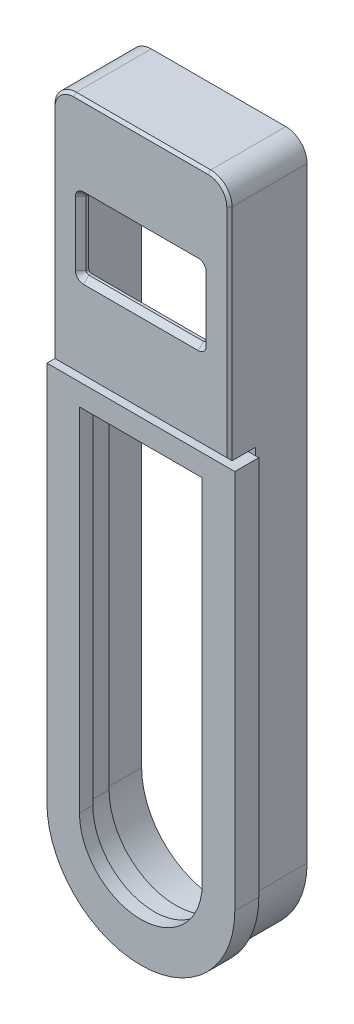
ISO-10303-21;
HEADER;
FILE_DESCRIPTION(('STEP AP214'),'2;1');
FILE_NAME('part.step','',(''),(''),'','','');
FILE_SCHEMA(('AUTOMOTIVE_DESIGN { 1 0 10303 214 1 1 1 1 }'));
ENDSEC;
DATA;
#1=APPLICATION_CONTEXT('core data for automotive mechanical design processes');
#2=APPLICATION_PROTOCOL_DEFINITION('international standard','automotive_design',2000,#1);
#3=PRODUCT_CONTEXT('',#1,'mechanical');
#4=PRODUCT('Part','Part','',(#3));
#5=PRODUCT_RELATED_PRODUCT_CATEGORY('part','',(#4));
#6=PRODUCT_DEFINITION_FORMATION('','',#4);
#7=PRODUCT_DEFINITION_CONTEXT('part definition',#1,'design');
#8=PRODUCT_DEFINITION('design','',#6,#7);
#9=PRODUCT_DEFINITION_SHAPE('','',#8);
#10=(LENGTH_UNIT() NAMED_UNIT(*) SI_UNIT(.MILLI.,.METRE.));
#11=(NAMED_UNIT(*) PLANE_ANGLE_UNIT() SI_UNIT($,.RADIAN.));
#12=(NAMED_UNIT(*) SI_UNIT($,.STERADIAN.) SOLID_ANGLE_UNIT());
#13=UNCERTAINTY_MEASURE_WITH_UNIT(LENGTH_MEASURE(1.E-05),#10,'distance_accuracy_value','');
#14=(GEOMETRIC_REPRESENTATION_CONTEXT(3) GLOBAL_UNCERTAINTY_ASSIGNED_CONTEXT((#13)) GLOBAL_UNIT_ASSIGNED_CONTEXT((#10,
#11,#12)) REPRESENTATION_CONTEXT('',''));
#15=CARTESIAN_POINT('',(0.,0.,0.));
#16=DIRECTION('',(0.,0.,1.));
#17=DIRECTION('',(1.,0.,0.));
#18=AXIS2_PLACEMENT_3D('',#15,#16,#17);
#19=CARTESIAN_POINT('',(16.6,16.6,12.05));
#20=DIRECTION('',(0.,0.,1.));
#21=DIRECTION('',(1.,0.,0.));
#22=AXIS2_PLACEMENT_3D('',#19,#20,#21);
#23=PLANE('',#22);
#24=DIRECTION('',(0.,1.,0.));
#25=VECTOR('',#24,1.);
#26=CARTESIAN_POINT('',(28.1,17.93,12.05));
#27=LINE('',#26,#25);
#28=CARTESIAN_POINT('',(28.1,17.93,12.05));
#29=VERTEX_POINT('',#28);
#30=CARTESIAN_POINT('',(28.1,83.84,12.05));
#31=VERTEX_POINT('',#30);
#32=EDGE_CURVE('E179',#29,#31,#27,.T.);
#33=ORIENTED_EDGE('',*,*,#32,.T.);
#34=DIRECTION('',(-1.,0.,0.));
#35=VECTOR('',#34,1.);
#36=CARTESIAN_POINT('',(28.1,83.84,12.05));
#37=LINE('',#36,#35);
#38=CARTESIAN_POINT('',(5.09999999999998,83.84,12.05));
#39=VERTEX_POINT('',#38);
#40=EDGE_CURVE('E176',#31,#39,#37,.T.);
#41=ORIENTED_EDGE('',*,*,#40,.T.);
#42=DIRECTION('',(0.,-1.,0.));
#43=VECTOR('',#42,1.);
#44=CARTESIAN_POINT('',(5.09999999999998,83.84,12.05));
#45=LINE('',#44,#43);
#46=CARTESIAN_POINT('',(5.09999999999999,17.93,12.05));
#47=VERTEX_POINT('',#46);
#48=EDGE_CURVE('E173',#39,#47,#45,.T.);
#49=ORIENTED_EDGE('',*,*,#48,.T.);
#50=CARTESIAN_POINT('',(16.6,17.93,12.05));
#51=DIRECTION('',(0.,0.,1.));
#52=DIRECTION('',(1.,0.,0.));
#53=AXIS2_PLACEMENT_3D('',#50,#51,#52);
#54=CIRCLE('',#53,11.5);
#55=EDGE_CURVE('E169',#47,#29,#54,.T.);
#56=ORIENTED_EDGE('',*,*,#55,.T.);
#57=EDGE_LOOP('',(#33,#41,#49,#56));
#58=FACE_BOUND('',#57,.T.);
#59=DIRECTION('',(0.,1.,0.));
#60=VECTOR('',#59,1.);
#61=CARTESIAN_POINT('',(32.2,16.6,12.05));
#62=LINE('',#61,#60);
#63=CARTESIAN_POINT('',(32.2,16.6,12.05));
#64=VERTEX_POINT('',#63);
#65=CARTESIAN_POINT('',(32.2,87.9,12.05));
#66=VERTEX_POINT('',#65);
#67=EDGE_CURVE('E62',#64,#66,#62,.T.);
#68=ORIENTED_EDGE('',*,*,#67,.F.);
#69=CARTESIAN_POINT('',(16.6,16.6,12.05));
#70=DIRECTION('',(0.,0.,1.));
#71=DIRECTION('',(-1.,0.,0.));
#72=AXIS2_PLACEMENT_3D('',#69,#70,#71);
#73=CIRCLE('',#72,15.6);
#74=CARTESIAN_POINT('',(0.999999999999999,16.6,12.05));
#75=VERTEX_POINT('',#74);
#76=EDGE_CURVE('E132',#75,#64,#73,.T.);
#77=ORIENTED_EDGE('',*,*,#76,.F.);
#78=DIRECTION('',(0.,-1.,0.));
#79=VECTOR('',#78,1.);
#80=CARTESIAN_POINT('',(0.999999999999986,87.9,12.05));
#81=LINE('',#80,#79);
#82=CARTESIAN_POINT('',(0.999999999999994,87.9,12.05));
#83=VERTEX_POINT('',#82);
#84=EDGE_CURVE('E67',#83,#75,#81,.T.);
#85=ORIENTED_EDGE('',*,*,#84,.F.);
#86=DIRECTION('',(-1.,0.,0.));
#87=VECTOR('',#86,1.);
#88=CARTESIAN_POINT('',(34.2,87.9,12.05));
#89=LINE('',#88,#87);
#90=EDGE_CURVE('E165',#66,#83,#89,.T.);
#91=ORIENTED_EDGE('',*,*,#90,.F.);
#92=EDGE_LOOP('',(#68,#77,#85,#91));
#93=FACE_BOUND('',#92,.T.);
#94=ADVANCED_FACE('F47',(#58,#93),#23,.F.);
#95=CARTESIAN_POINT('',(34.2,87.9,110.165113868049));
#96=DIRECTION('',(0.,-1.,0.));
#97=DIRECTION('',(0.,0.,-1.));
#98=AXIS2_PLACEMENT_3D('',#95,#96,#97);
#99=PLANE('',#98);
#100=DIRECTION('',(0.,0.,-1.));
#101=VECTOR('',#100,1.);
#102=CARTESIAN_POINT('',(-1.00000000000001,87.9,110.165113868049));
#103=LINE('',#102,#101);
#104=CARTESIAN_POINT('',(-1.00000000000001,87.9,14.55));
#105=VERTEX_POINT('',#104);
#106=CARTESIAN_POINT('',(-1.00000000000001,87.9,10.05));
#107=VERTEX_POINT('',#106);
#108=EDGE_CURVE('E185',#105,#107,#103,.T.);
#109=ORIENTED_EDGE('',*,*,#108,.F.);
#110=DIRECTION('',(1.,0.,0.));
#111=VECTOR('',#110,1.);
#112=CARTESIAN_POINT('',(34.2,87.9,14.55));
#113=LINE('',#112,#111);
#114=CARTESIAN_POINT('',(34.2,87.9,14.55));
#115=VERTEX_POINT('',#114);
#116=EDGE_CURVE('E172',#105,#115,#113,.T.);
#117=ORIENTED_EDGE('',*,*,#116,.T.);
#118=DIRECTION('',(0.,0.,-1.));
#119=VECTOR('',#118,1.);
#120=CARTESIAN_POINT('',(34.2,87.9,110.165113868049));
#121=LINE('',#120,#119);
#122=CARTESIAN_POINT('',(34.2,87.9,10.05));
#123=VERTEX_POINT('',#122);
#124=EDGE_CURVE('E168',#115,#123,#121,.T.);
#125=ORIENTED_EDGE('',*,*,#124,.T.);
#126=DIRECTION('',(-1.,0.,0.));
#127=VECTOR('',#126,1.);
#128=CARTESIAN_POINT('',(32.2,87.9,10.05));
#129=LINE('',#128,#127);
#130=CARTESIAN_POINT('',(32.2,87.9,10.05));
#131=VERTEX_POINT('',#130);
#132=EDGE_CURVE('E384',#123,#131,#129,.T.);
#133=ORIENTED_EDGE('',*,*,#132,.T.);
#134=DIRECTION('',(0.,0.,1.));
#135=VECTOR('',#134,1.);
#136=CARTESIAN_POINT('',(32.2,87.9,-85.9151138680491));
#137=LINE('',#136,#135);
#138=EDGE_CURVE('E156',#131,#66,#137,.T.);
#139=ORIENTED_EDGE('',*,*,#138,.T.);
#140=ORIENTED_EDGE('',*,*,#90,.T.);
#141=DIRECTION('',(0.,0.,1.));
#142=VECTOR('',#141,1.);
#143=CARTESIAN_POINT('',(0.999999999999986,87.9,-85.9151138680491));
#144=LINE('',#143,#142);
#145=CARTESIAN_POINT('',(0.999999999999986,87.9,10.05));
#146=VERTEX_POINT('',#145);
#147=EDGE_CURVE('E144',#146,#83,#144,.T.);
#148=ORIENTED_EDGE('',*,*,#147,.F.);
#149=DIRECTION('',(-1.,0.,0.));
#150=VECTOR('',#149,1.);
#151=CARTESIAN_POINT('',(0.999999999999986,87.9,10.05));
#152=LINE('',#151,#150);
#153=EDGE_CURVE('E152',#146,#107,#152,.T.);
#154=ORIENTED_EDGE('',*,*,#153,.T.);
#155=EDGE_LOOP('',(#109,#117,#125,#133,#139,#140,#148,#154));
#156=FACE_BOUND('',#155,.T.);
#157=ADVANCED_FACE('F234',(#156),#99,.F.);
#158=CARTESIAN_POINT('',(-1.00000000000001,87.9,110.165113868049));
#159=DIRECTION('',(1.,0.,0.));
#160=DIRECTION('',(0.,1.,0.));
#161=AXIS2_PLACEMENT_3D('',#158,#159,#160);
#162=PLANE('',#161);
#163=DIRECTION('',(0.,0.,-1.));
#164=VECTOR('',#163,1.);
#165=CARTESIAN_POINT('',(-1.,16.6,110.165113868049));
#166=LINE('',#165,#164);
#167=CARTESIAN_POINT('',(-1.,16.6,14.55));
#168=VERTEX_POINT('',#167);
#169=CARTESIAN_POINT('',(-1.,16.6,10.05));
#170=VERTEX_POINT('',#169);
#171=EDGE_CURVE('E188',#168,#170,#166,.T.);
#172=ORIENTED_EDGE('',*,*,#171,.F.);
#173=DIRECTION('',(0.,1.,0.));
#174=VECTOR('',#173,1.);
#175=CARTESIAN_POINT('',(-1.00000000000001,87.9,14.55));
#176=LINE('',#175,#174);
#177=EDGE_CURVE('E167',#168,#105,#176,.T.);
#178=ORIENTED_EDGE('',*,*,#177,.T.);
#179=ORIENTED_EDGE('',*,*,#108,.T.);
#180=DIRECTION('',(0.,-1.,0.));
#181=VECTOR('',#180,1.);
#182=CARTESIAN_POINT('',(-1.00000000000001,87.9,10.05));
#183=LINE('',#182,#181);
#184=EDGE_CURVE('E161',#107,#170,#183,.T.);
#185=ORIENTED_EDGE('',*,*,#184,.T.);
#186=EDGE_LOOP('',(#172,#178,#179,#185));
#187=FACE_BOUND('',#186,.T.);
#188=ADVANCED_FACE('F239',(#187),#162,.F.);
#189=CARTESIAN_POINT('',(16.6,16.6,110.165113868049));
#190=DIRECTION('',(0.,0.,-1.));
#191=DIRECTION('',(-1.,0.,0.));
#192=AXIS2_PLACEMENT_3D('',#189,#190,#191);
#193=CYLINDRICAL_SURFACE('',#192,17.6);
#194=DIRECTION('',(0.,0.,-1.));
#195=VECTOR('',#194,1.);
#196=CARTESIAN_POINT('',(34.2,16.6,110.165113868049));
#197=LINE('',#196,#195);
#198=CARTESIAN_POINT('',(34.2,16.6,14.55));
#199=VERTEX_POINT('',#198);
#200=CARTESIAN_POINT('',(34.2,16.6,10.05));
#201=VERTEX_POINT('',#200);
#202=EDGE_CURVE('E191',#199,#201,#197,.T.);
#203=ORIENTED_EDGE('',*,*,#202,.F.);
#204=CARTESIAN_POINT('',(16.6,16.6,14.55));
#205=DIRECTION('',(0.,0.,-1.));
#206=DIRECTION('',(-1.,0.,0.));
#207=AXIS2_PLACEMENT_3D('',#204,#205,#206);
#208=CIRCLE('',#207,17.6);
#209=EDGE_CURVE('E187',#199,#168,#208,.T.);
#210=ORIENTED_EDGE('',*,*,#209,.T.);
#211=ORIENTED_EDGE('',*,*,#171,.T.);
#212=CARTESIAN_POINT('',(16.6,16.6,10.05));
#213=DIRECTION('',(0.,0.,1.));
#214=DIRECTION('',(1.,0.,0.));
#215=AXIS2_PLACEMENT_3D('',#212,#213,#214);
#216=CIRCLE('',#215,17.6);
#217=EDGE_CURVE('E164',#170,#201,#216,.T.);
#218=ORIENTED_EDGE('',*,*,#217,.T.);
#219=EDGE_LOOP('',(#203,#210,#211,#218));
#220=FACE_BOUND('',#219,.T.);
#221=ADVANCED_FACE('F248',(#220),#193,.T.);
#222=CARTESIAN_POINT('',(34.2,16.6,110.165113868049));
#223=DIRECTION('',(-1.,0.,0.));
#224=DIRECTION('',(0.,0.,1.));
#225=AXIS2_PLACEMENT_3D('',#222,#223,#224);
#226=PLANE('',#225);
#227=ORIENTED_EDGE('',*,*,#124,.F.);
#228=DIRECTION('',(0.,-1.,0.));
#229=VECTOR('',#228,1.);
#230=CARTESIAN_POINT('',(34.2,16.6,14.55));
#231=LINE('',#230,#229);
#232=EDGE_CURVE('E190',#115,#199,#231,.T.);
#233=ORIENTED_EDGE('',*,*,#232,.T.);
#234=ORIENTED_EDGE('',*,*,#202,.T.);
#235=DIRECTION('',(0.,1.,0.));
#236=VECTOR('',#235,1.);
#237=CARTESIAN_POINT('',(34.2,16.6,10.05));
#238=LINE('',#237,#236);
#239=EDGE_CURVE('E387',#201,#123,#238,.T.);
#240=ORIENTED_EDGE('',*,*,#239,.T.);
#241=EDGE_LOOP('',(#227,#233,#234,#240));
#242=FACE_BOUND('',#241,.T.);
#243=ADVANCED_FACE('F245',(#242),#226,.F.);
#244=CARTESIAN_POINT('',(28.1,17.93,110.165113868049));
#245=DIRECTION('',(-1.,0.,0.));
#246=DIRECTION('',(0.,0.,1.));
#247=AXIS2_PLACEMENT_3D('',#244,#245,#246);
#248=PLANE('',#247);
#249=DIRECTION('',(0.,-1.,0.));
#250=VECTOR('',#249,1.);
#251=CARTESIAN_POINT('',(28.1,17.93,14.55));
#252=LINE('',#251,#250);
#253=CARTESIAN_POINT('',(28.1,83.84,14.55));
#254=VERTEX_POINT('',#253);
#255=CARTESIAN_POINT('',(28.1,17.93,14.55));
#256=VERTEX_POINT('',#255);
#257=EDGE_CURVE('E184',#254,#256,#252,.T.);
#258=ORIENTED_EDGE('',*,*,#257,.F.);
#259=DIRECTION('',(0.,0.,-1.));
#260=VECTOR('',#259,1.);
#261=CARTESIAN_POINT('',(28.1,83.84,110.165113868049));
#262=LINE('',#261,#260);
#263=EDGE_CURVE('E193',#254,#31,#262,.T.);
#264=ORIENTED_EDGE('',*,*,#263,.T.);
#265=ORIENTED_EDGE('',*,*,#32,.F.);
#266=DIRECTION('',(0.,0.,-1.));
#267=VECTOR('',#266,1.);
#268=CARTESIAN_POINT('',(28.1,17.93,110.165113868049));
#269=LINE('',#268,#267);
#270=EDGE_CURVE('E200',#256,#29,#269,.T.);
#271=ORIENTED_EDGE('',*,*,#270,.F.);
#272=EDGE_LOOP('',(#258,#264,#265,#271));
#273=FACE_BOUND('',#272,.T.);
#274=ADVANCED_FACE('F220',(#273),#248,.T.);
#275=CARTESIAN_POINT('',(28.1,83.84,110.165113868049));
#276=DIRECTION('',(0.,-1.,0.));
#277=DIRECTION('',(0.,0.,-1.));
#278=AXIS2_PLACEMENT_3D('',#275,#276,#277);
#279=PLANE('',#278);
#280=DIRECTION('',(1.,0.,0.));
#281=VECTOR('',#280,1.);
#282=CARTESIAN_POINT('',(28.1,83.84,14.55));
#283=LINE('',#282,#281);
#284=CARTESIAN_POINT('',(5.09999999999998,83.84,14.55));
#285=VERTEX_POINT('',#284);
#286=EDGE_CURVE('E13',#285,#254,#283,.T.);
#287=ORIENTED_EDGE('',*,*,#286,.F.);
#288=DIRECTION('',(0.,0.,-1.));
#289=VECTOR('',#288,1.);
#290=CARTESIAN_POINT('',(5.09999999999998,83.84,110.165113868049));
#291=LINE('',#290,#289);
#292=EDGE_CURVE('E196',#285,#39,#291,.T.);
#293=ORIENTED_EDGE('',*,*,#292,.T.);
#294=ORIENTED_EDGE('',*,*,#40,.F.);
#295=ORIENTED_EDGE('',*,*,#263,.F.);
#296=EDGE_LOOP('',(#287,#293,#294,#295));
#297=FACE_BOUND('',#296,.T.);
#298=ADVANCED_FACE('F230',(#297),#279,.T.);
#299=CARTESIAN_POINT('',(5.09999999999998,83.84,110.165113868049));
#300=DIRECTION('',(1.,0.,0.));
#301=DIRECTION('',(0.,1.,0.));
#302=AXIS2_PLACEMENT_3D('',#299,#300,#301);
#303=PLANE('',#302);
#304=DIRECTION('',(0.,1.,0.));
#305=VECTOR('',#304,1.);
#306=CARTESIAN_POINT('',(5.09999999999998,83.84,14.55));
#307=LINE('',#306,#305);
#308=CARTESIAN_POINT('',(5.09999999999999,17.93,14.55));
#309=VERTEX_POINT('',#308);
#310=EDGE_CURVE('E51',#309,#285,#307,.T.);
#311=ORIENTED_EDGE('',*,*,#310,.F.);
#312=DIRECTION('',(0.,0.,-1.));
#313=VECTOR('',#312,1.);
#314=CARTESIAN_POINT('',(5.09999999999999,17.93,110.165113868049));
#315=LINE('',#314,#313);
#316=EDGE_CURVE('E198',#309,#47,#315,.T.);
#317=ORIENTED_EDGE('',*,*,#316,.T.);
#318=ORIENTED_EDGE('',*,*,#48,.F.);
#319=ORIENTED_EDGE('',*,*,#292,.F.);
#320=EDGE_LOOP('',(#311,#317,#318,#319));
#321=FACE_BOUND('',#320,.T.);
#322=ADVANCED_FACE('F227',(#321),#303,.T.);
#323=CARTESIAN_POINT('',(16.6,17.93,110.165113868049));
#324=DIRECTION('',(0.,0.,-1.));
#325=DIRECTION('',(-1.,0.,0.));
#326=AXIS2_PLACEMENT_3D('',#323,#324,#325);
#327=CYLINDRICAL_SURFACE('',#326,11.5);
#328=CARTESIAN_POINT('',(16.6,17.93,14.55));
#329=DIRECTION('',(0.,0.,-1.));
#330=DIRECTION('',(-1.,0.,0.));
#331=AXIS2_PLACEMENT_3D('',#328,#329,#330);
#332=CIRCLE('',#331,11.5);
#333=EDGE_CURVE('E182',#256,#309,#332,.T.);
#334=ORIENTED_EDGE('',*,*,#333,.F.);
#335=ORIENTED_EDGE('',*,*,#270,.T.);
#336=ORIENTED_EDGE('',*,*,#55,.F.);
#337=ORIENTED_EDGE('',*,*,#316,.F.);
#338=EDGE_LOOP('',(#334,#335,#336,#337));
#339=FACE_BOUND('',#338,.T.);
#340=ADVANCED_FACE('F224',(#339),#327,.F.);
#341=CARTESIAN_POINT('',(0.,0.,14.55));
#342=DIRECTION('',(0.,0.,-1.));
#343=DIRECTION('',(-1.,0.,0.));
#344=AXIS2_PLACEMENT_3D('',#341,#342,#343);
#345=PLANE('',#344);
#346=ORIENTED_EDGE('',*,*,#257,.T.);
#347=ORIENTED_EDGE('',*,*,#333,.T.);
#348=ORIENTED_EDGE('',*,*,#310,.T.);
#349=ORIENTED_EDGE('',*,*,#286,.T.);
#350=EDGE_LOOP('',(#346,#347,#348,#349));
#351=FACE_BOUND('',#350,.T.);
#352=ORIENTED_EDGE('',*,*,#177,.F.);
#353=ORIENTED_EDGE('',*,*,#209,.F.);
#354=ORIENTED_EDGE('',*,*,#232,.F.);
#355=ORIENTED_EDGE('',*,*,#116,.F.);
#356=EDGE_LOOP('',(#352,#353,#354,#355));
#357=FACE_BOUND('',#356,.T.);
#358=ADVANCED_FACE('F49',(#351,#357),#345,.F.);
#359=CARTESIAN_POINT('',(32.2,16.6,-85.9151138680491));
#360=DIRECTION('',(1.,0.,0.));
#361=DIRECTION('',(0.,1.,0.));
#362=AXIS2_PLACEMENT_3D('',#359,#360,#361);
#363=PLANE('',#362);
#364=ORIENTED_EDGE('',*,*,#138,.F.);
#365=DIRECTION('',(0.,-1.,0.));
#366=VECTOR('',#365,1.);
#367=CARTESIAN_POINT('',(32.2,16.6,10.05));
#368=LINE('',#367,#366);
#369=CARTESIAN_POINT('',(32.2,16.6,10.05));
#370=VERTEX_POINT('',#369);
#371=EDGE_CURVE('E379',#131,#370,#368,.T.);
#372=ORIENTED_EDGE('',*,*,#371,.T.);
#373=DIRECTION('',(0.,0.,1.));
#374=VECTOR('',#373,1.);
#375=CARTESIAN_POINT('',(32.2,16.6,-85.9151138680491));
#376=LINE('',#375,#374);
#377=EDGE_CURVE('E145',#370,#64,#376,.T.);
#378=ORIENTED_EDGE('',*,*,#377,.T.);
#379=ORIENTED_EDGE('',*,*,#67,.T.);
#380=EDGE_LOOP('',(#364,#372,#378,#379));
#381=FACE_BOUND('',#380,.T.);
#382=ADVANCED_FACE('F284',(#381),#363,.F.);
#383=CARTESIAN_POINT('',(16.6,16.6,-85.9151138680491));
#384=DIRECTION('',(0.,0.,1.));
#385=DIRECTION('',(1.,0.,0.));
#386=AXIS2_PLACEMENT_3D('',#383,#384,#385);
#387=CYLINDRICAL_SURFACE('',#386,15.6);
#388=ORIENTED_EDGE('',*,*,#377,.F.);
#389=CARTESIAN_POINT('',(16.6,16.6,10.05));
#390=DIRECTION('',(0.,0.,1.));
#391=DIRECTION('',(1.,0.,0.));
#392=AXIS2_PLACEMENT_3D('',#389,#390,#391);
#393=CIRCLE('',#392,15.6);
#394=CARTESIAN_POINT('',(1.,16.6,10.05));
#395=VERTEX_POINT('',#394);
#396=EDGE_CURVE('E141',#370,#395,#393,.F.);
#397=ORIENTED_EDGE('',*,*,#396,.T.);
#398=DIRECTION('',(0.,0.,1.));
#399=VECTOR('',#398,1.);
#400=CARTESIAN_POINT('',(0.999999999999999,16.6,-85.9151138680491));
#401=LINE('',#400,#399);
#402=EDGE_CURVE('E139',#395,#75,#401,.T.);
#403=ORIENTED_EDGE('',*,*,#402,.T.);
#404=ORIENTED_EDGE('',*,*,#76,.T.);
#405=EDGE_LOOP('',(#388,#397,#403,#404));
#406=FACE_BOUND('',#405,.T.);
#407=ADVANCED_FACE('F140',(#406),#387,.F.);
#408=CARTESIAN_POINT('',(0.999999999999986,87.9,-85.9151138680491));
#409=DIRECTION('',(-1.,0.,0.));
#410=DIRECTION('',(0.,-1.,0.));
#411=AXIS2_PLACEMENT_3D('',#408,#409,#410);
#412=PLANE('',#411);
#413=ORIENTED_EDGE('',*,*,#402,.F.);
#414=DIRECTION('',(0.,1.,0.));
#415=VECTOR('',#414,1.);
#416=CARTESIAN_POINT('',(0.999999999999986,87.9,10.05));
#417=LINE('',#416,#415);
#418=EDGE_CURVE('E376',#395,#146,#417,.T.);
#419=ORIENTED_EDGE('',*,*,#418,.T.);
#420=ORIENTED_EDGE('',*,*,#147,.T.);
#421=ORIENTED_EDGE('',*,*,#84,.T.);
#422=EDGE_LOOP('',(#413,#419,#420,#421));
#423=FACE_BOUND('',#422,.T.);
#424=ADVANCED_FACE('F148',(#423),#412,.F.);
#425=CARTESIAN_POINT('',(0.,0.,10.05));
#426=DIRECTION('',(0.,0.,1.));
#427=DIRECTION('',(1.,0.,0.));
#428=AXIS2_PLACEMENT_3D('',#425,#426,#427);
#429=PLANE('',#428);
#430=ORIENTED_EDGE('',*,*,#418,.F.);
#431=ORIENTED_EDGE('',*,*,#396,.F.);
#432=ORIENTED_EDGE('',*,*,#371,.F.);
#433=ORIENTED_EDGE('',*,*,#132,.F.);
#434=ORIENTED_EDGE('',*,*,#239,.F.);
#435=ORIENTED_EDGE('',*,*,#217,.F.);
#436=ORIENTED_EDGE('',*,*,#184,.F.);
#437=ORIENTED_EDGE('',*,*,#153,.F.);
#438=EDGE_LOOP('',(#430,#431,#432,#433,#434,#435,#436,#437));
#439=FACE_BOUND('',#438,.T.);
#440=ADVANCED_FACE('F302',(#439),#429,.F.);
#441=CLOSED_SHELL('',(#94,#157,#188,#221,#243,#274,#298,#322,#340,#358,#382,#407,#424,#440));
#442=MANIFOLD_SOLID_BREP('B2',#441);
#443=CARTESIAN_POINT('',(0.,0.,0.));
#444=DIRECTION('',(0.,0.,-1.));
#445=DIRECTION('',(-1.,0.,0.));
#446=AXIS2_PLACEMENT_3D('',#443,#444,#445);
#447=PLANE('',#446);
#448=CARTESIAN_POINT('',(16.6,16.6,0.));
#449=DIRECTION('',(0.,0.,-1.));
#450=DIRECTION('',(-1.,0.,0.));
#451=AXIS2_PLACEMENT_3D('',#448,#449,#450);
#452=CIRCLE('',#451,14.4);
#453=CARTESIAN_POINT('',(31.,16.6,0.));
#454=VERTEX_POINT('',#453);
#455=CARTESIAN_POINT('',(2.2,16.6,0.));
#456=VERTEX_POINT('',#455);
#457=EDGE_CURVE('E836',#454,#456,#452,.T.);
#458=ORIENTED_EDGE('',*,*,#457,.F.);
#459=DIRECTION('',(0.,1.,0.));
#460=VECTOR('',#459,1.);
#461=CARTESIAN_POINT('',(31.,0.,0.));
#462=LINE('',#461,#460);
#463=CARTESIAN_POINT('',(31.,87.44,0.));
#464=VERTEX_POINT('',#463);
#465=EDGE_CURVE('E811',#454,#464,#462,.T.);
#466=ORIENTED_EDGE('',*,*,#465,.T.);
#467=DIRECTION('',(-1.,0.,0.));
#468=VECTOR('',#467,1.);
#469=CARTESIAN_POINT('',(0.,87.44,0.));
#470=LINE('',#469,#468);
#471=CARTESIAN_POINT('',(2.19999999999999,87.44,0.));
#472=VERTEX_POINT('',#471);
#473=EDGE_CURVE('E817',#464,#472,#470,.T.);
#474=ORIENTED_EDGE('',*,*,#473,.T.);
#475=DIRECTION('',(0.,-1.,0.));
#476=VECTOR('',#475,1.);
#477=CARTESIAN_POINT('',(2.2,0.,0.));
#478=LINE('',#477,#476);
#479=EDGE_CURVE('E839',#472,#456,#478,.T.);
#480=ORIENTED_EDGE('',*,*,#479,.T.);
#481=EDGE_LOOP('',(#458,#466,#474,#480));
#482=FACE_BOUND('',#481,.T.);
#483=DIRECTION('',(-1.,0.,0.));
#484=VECTOR('',#483,1.);
#485=CARTESIAN_POINT('',(0.,134.1,0.));
#486=LINE('',#485,#484);
#487=CARTESIAN_POINT('',(29.2,134.1,0.));
#488=VERTEX_POINT('',#487);
#489=CARTESIAN_POINT('',(3.99999999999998,134.1,0.));
#490=VERTEX_POINT('',#489);
#491=EDGE_CURVE('E934',#488,#490,#486,.T.);
#492=ORIENTED_EDGE('',*,*,#491,.F.);
#493=CARTESIAN_POINT('',(29.2,130.1,0.));
#494=DIRECTION('',(0.,0.,-1.));
#495=DIRECTION('',(-1.,0.,0.));
#496=AXIS2_PLACEMENT_3D('',#493,#494,#495);
#497=CIRCLE('',#496,4.);
#498=CARTESIAN_POINT('',(33.2,130.1,0.));
#499=VERTEX_POINT('',#498);
#500=EDGE_CURVE('E978',#488,#499,#497,.T.);
#501=ORIENTED_EDGE('',*,*,#500,.T.);
#502=DIRECTION('',(0.,1.,0.));
#503=VECTOR('',#502,1.);
#504=CARTESIAN_POINT('',(33.2,0.,0.));
#505=LINE('',#504,#503);
#506=CARTESIAN_POINT('',(33.2,16.6,0.));
#507=VERTEX_POINT('',#506);
#508=EDGE_CURVE('E931',#507,#499,#505,.T.);
#509=ORIENTED_EDGE('',*,*,#508,.F.);
#510=CARTESIAN_POINT('',(16.6,16.6,0.));
#511=DIRECTION('',(0.,0.,-1.));
#512=DIRECTION('',(-1.,0.,0.));
#513=AXIS2_PLACEMENT_3D('',#510,#511,#512);
#514=CIRCLE('',#513,16.6);
#515=CARTESIAN_POINT('',(16.6,0.,0.));
#516=VERTEX_POINT('',#515);
#517=EDGE_CURVE('E936',#507,#516,#514,.T.);
#518=ORIENTED_EDGE('',*,*,#517,.T.);
#519=CARTESIAN_POINT('',(16.6,16.6,0.));
#520=DIRECTION('',(0.,0.,-1.));
#521=DIRECTION('',(-1.,0.,0.));
#522=AXIS2_PLACEMENT_3D('',#519,#520,#521);
#523=CIRCLE('',#522,16.6);
#524=CARTESIAN_POINT('',(0.,16.6,0.));
#525=VERTEX_POINT('',#524);
#526=EDGE_CURVE('E938',#516,#525,#523,.T.);
#527=ORIENTED_EDGE('',*,*,#526,.T.);
#528=DIRECTION('',(0.,-1.,0.));
#529=VECTOR('',#528,1.);
#530=CARTESIAN_POINT('',(0.,0.,0.));
#531=LINE('',#530,#529);
#532=CARTESIAN_POINT('',(0.,130.1,0.));
#533=VERTEX_POINT('',#532);
#534=EDGE_CURVE('E929',#533,#525,#531,.T.);
#535=ORIENTED_EDGE('',*,*,#534,.F.);
#536=CARTESIAN_POINT('',(3.99999999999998,130.1,0.));
#537=DIRECTION('',(0.,0.,-1.));
#538=DIRECTION('',(-1.,0.,0.));
#539=AXIS2_PLACEMENT_3D('',#536,#537,#538);
#540=CIRCLE('',#539,4.);
#541=EDGE_CURVE('E970',#533,#490,#540,.T.);
#542=ORIENTED_EDGE('',*,*,#541,.T.);
#543=EDGE_LOOP('',(#492,#501,#509,#518,#527,#535,#542));
#544=FACE_BOUND('',#543,.T.);
#545=DIRECTION('',(-1.,0.,0.));
#546=VECTOR('',#545,1.);
#547=CARTESIAN_POINT('',(0.,131.7,0.));
#548=LINE('',#547,#546);
#549=CARTESIAN_POINT('',(30.5,131.7,0.));
#550=VERTEX_POINT('',#549);
#551=CARTESIAN_POINT('',(2.69999999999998,131.7,0.));
#552=VERTEX_POINT('',#551);
#553=EDGE_CURVE('E803',#550,#552,#548,.T.);
#554=ORIENTED_EDGE('',*,*,#553,.T.);
#555=CARTESIAN_POINT('',(2.69999999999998,131.2,0.));
#556=DIRECTION('',(0.,0.,-1.));
#557=DIRECTION('',(-1.,0.,0.));
#558=AXIS2_PLACEMENT_3D('',#555,#556,#557);
#559=CIRCLE('',#558,0.5);
#560=CARTESIAN_POINT('',(2.19999999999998,131.2,0.));
#561=VERTEX_POINT('',#560);
#562=EDGE_CURVE('E999',#552,#561,#559,.F.);
#563=ORIENTED_EDGE('',*,*,#562,.T.);
#564=DIRECTION('',(0.,-1.,0.));
#565=VECTOR('',#564,1.);
#566=CARTESIAN_POINT('',(2.2,0.,0.));
#567=LINE('',#566,#565);
#568=CARTESIAN_POINT('',(2.19999999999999,90.44,0.));
#569=VERTEX_POINT('',#568);
#570=EDGE_CURVE('E801',#561,#569,#567,.T.);
#571=ORIENTED_EDGE('',*,*,#570,.T.);
#572=DIRECTION('',(1.,0.,0.));
#573=VECTOR('',#572,1.);
#574=CARTESIAN_POINT('',(0.,90.44,0.));
#575=LINE('',#574,#573);
#576=CARTESIAN_POINT('',(31.,90.44,0.));
#577=VERTEX_POINT('',#576);
#578=EDGE_CURVE('E765',#569,#577,#575,.T.);
#579=ORIENTED_EDGE('',*,*,#578,.T.);
#580=DIRECTION('',(0.,1.,0.));
#581=VECTOR('',#580,1.);
#582=CARTESIAN_POINT('',(30.9999999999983,-4.03323208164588E-13,0.));
#583=LINE('',#582,#581);
#584=CARTESIAN_POINT('',(31.,131.2,0.));
#585=VERTEX_POINT('',#584);
#586=EDGE_CURVE('E770',#577,#585,#583,.T.);
#587=ORIENTED_EDGE('',*,*,#586,.T.);
#588=CARTESIAN_POINT('',(30.5,131.2,0.));
#589=DIRECTION('',(0.,0.,-1.));
#590=DIRECTION('',(-1.,0.,0.));
#591=AXIS2_PLACEMENT_3D('',#588,#589,#590);
#592=CIRCLE('',#591,0.5);
#593=EDGE_CURVE('E1001',#585,#550,#592,.F.);
#594=ORIENTED_EDGE('',*,*,#593,.T.);
#595=EDGE_LOOP('',(#554,#563,#571,#579,#587,#594));
#596=FACE_BOUND('',#595,.T.);
#597=ADVANCED_FACE('F403',(#482,#544,#596),#447,.T.);
#598=CARTESIAN_POINT('',(5.34999999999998,118.1,0.));
#599=DIRECTION('',(-1.,0.,0.));
#600=DIRECTION('',(0.,-1.,0.));
#601=AXIS2_PLACEMENT_3D('',#598,#599,#600);
#602=PLANE('',#601);
#603=DIRECTION('',(0.,0.,1.));
#604=VECTOR('',#603,1.);
#605=CARTESIAN_POINT('',(5.34999999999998,117.6,14.55));
#606=LINE('',#605,#604);
#607=CARTESIAN_POINT('',(5.34999999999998,117.6,13.06));
#608=VERTEX_POINT('',#607);
#609=CARTESIAN_POINT('',(5.34999999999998,117.6,13.55));
#610=VERTEX_POINT('',#609);
#611=EDGE_CURVE('E958',#608,#610,#606,.T.);
#612=ORIENTED_EDGE('',*,*,#611,.T.);
#613=DIRECTION('',(0.,-1.,0.));
#614=VECTOR('',#613,1.);
#615=CARTESIAN_POINT('',(5.34999999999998,118.1,13.55));
#616=LINE('',#615,#614);
#617=CARTESIAN_POINT('',(5.34999999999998,105.6,13.55));
#618=VERTEX_POINT('',#617);
#619=EDGE_CURVE('E1003',#610,#618,#616,.T.);
#620=ORIENTED_EDGE('',*,*,#619,.T.);
#621=DIRECTION('',(0.,0.,1.));
#622=VECTOR('',#621,1.);
#623=CARTESIAN_POINT('',(5.34999999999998,105.6,0.));
#624=LINE('',#623,#622);
#625=CARTESIAN_POINT('',(5.34999999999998,105.6,13.06));
#626=VERTEX_POINT('',#625);
#627=EDGE_CURVE('E961',#618,#626,#624,.F.);
#628=ORIENTED_EDGE('',*,*,#627,.T.);
#629=DIRECTION('',(0.,-1.,0.));
#630=VECTOR('',#629,1.);
#631=CARTESIAN_POINT('',(5.34999999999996,0.,13.06));
#632=LINE('',#631,#630);
#633=EDGE_CURVE('E785',#608,#626,#632,.T.);
#634=ORIENTED_EDGE('',*,*,#633,.F.);
#635=EDGE_LOOP('',(#612,#620,#628,#634));
#636=FACE_BOUND('',#635,.T.);
#637=ADVANCED_FACE('F1183',(#636),#602,.F.);
#638=CARTESIAN_POINT('',(5.34999999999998,118.1,0.));
#639=DIRECTION('',(0.,1.,0.));
#640=DIRECTION('',(0.,0.,1.));
#641=AXIS2_PLACEMENT_3D('',#638,#639,#640);
#642=PLANE('',#641);
#643=DIRECTION('',(0.,0.,1.));
#644=VECTOR('',#643,1.);
#645=CARTESIAN_POINT('',(27.35,118.1,14.55));
#646=LINE('',#645,#644);
#647=CARTESIAN_POINT('',(27.35,118.1,13.06));
#648=VERTEX_POINT('',#647);
#649=CARTESIAN_POINT('',(27.35,118.1,13.55));
#650=VERTEX_POINT('',#649);
#651=EDGE_CURVE('E963',#648,#650,#646,.T.);
#652=ORIENTED_EDGE('',*,*,#651,.T.);
#653=DIRECTION('',(-1.,0.,0.));
#654=VECTOR('',#653,1.);
#655=CARTESIAN_POINT('',(5.34999999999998,118.1,13.55));
#656=LINE('',#655,#654);
#657=CARTESIAN_POINT('',(5.84999999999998,118.1,13.55));
#658=VERTEX_POINT('',#657);
#659=EDGE_CURVE('E1029',#650,#658,#656,.T.);
#660=ORIENTED_EDGE('',*,*,#659,.T.);
#661=DIRECTION('',(0.,0.,1.));
#662=VECTOR('',#661,1.);
#663=CARTESIAN_POINT('',(5.84999999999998,118.1,0.));
#664=LINE('',#663,#662);
#665=CARTESIAN_POINT('',(5.84999999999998,118.1,13.06));
#666=VERTEX_POINT('',#665);
#667=EDGE_CURVE('E966',#658,#666,#664,.F.);
#668=ORIENTED_EDGE('',*,*,#667,.T.);
#669=DIRECTION('',(-1.,0.,0.));
#670=VECTOR('',#669,1.);
#671=CARTESIAN_POINT('',(0.,118.1,13.06));
#672=LINE('',#671,#670);
#673=EDGE_CURVE('E780',#648,#666,#672,.T.);
#674=ORIENTED_EDGE('',*,*,#673,.F.);
#675=EDGE_LOOP('',(#652,#660,#668,#674));
#676=FACE_BOUND('',#675,.T.);
#677=ADVANCED_FACE('F1189',(#676),#642,.F.);
#678=CARTESIAN_POINT('',(27.85,118.1,0.));
#679=DIRECTION('',(1.,0.,0.));
#680=DIRECTION('',(0.,0.,-1.));
#681=AXIS2_PLACEMENT_3D('',#678,#679,#680);
#682=PLANE('',#681);
#683=DIRECTION('',(0.,0.,1.));
#684=VECTOR('',#683,1.);
#685=CARTESIAN_POINT('',(27.85,105.6,14.55));
#686=LINE('',#685,#684);
#687=CARTESIAN_POINT('',(27.85,105.6,13.06));
#688=VERTEX_POINT('',#687);
#689=CARTESIAN_POINT('',(27.85,105.6,13.55));
#690=VERTEX_POINT('',#689);
#691=EDGE_CURVE('E950',#688,#690,#686,.T.);
#692=ORIENTED_EDGE('',*,*,#691,.T.);
#693=DIRECTION('',(0.,1.,0.));
#694=VECTOR('',#693,1.);
#695=CARTESIAN_POINT('',(27.85,118.1,13.55));
#696=LINE('',#695,#694);
#697=CARTESIAN_POINT('',(27.85,117.6,13.55));
#698=VERTEX_POINT('',#697);
#699=EDGE_CURVE('E1035',#690,#698,#696,.T.);
#700=ORIENTED_EDGE('',*,*,#699,.T.);
#701=DIRECTION('',(0.,0.,1.));
#702=VECTOR('',#701,1.);
#703=CARTESIAN_POINT('',(27.85,117.6,0.));
#704=LINE('',#703,#702);
#705=CARTESIAN_POINT('',(27.85,117.6,13.06));
#706=VERTEX_POINT('',#705);
#707=EDGE_CURVE('E946',#698,#706,#704,.F.);
#708=ORIENTED_EDGE('',*,*,#707,.T.);
#709=DIRECTION('',(0.,1.,0.));
#710=VECTOR('',#709,1.);
#711=CARTESIAN_POINT('',(27.85,0.,13.06));
#712=LINE('',#711,#710);
#713=EDGE_CURVE('E795',#688,#706,#712,.T.);
#714=ORIENTED_EDGE('',*,*,#713,.F.);
#715=EDGE_LOOP('',(#692,#700,#708,#714));
#716=FACE_BOUND('',#715,.T.);
#717=ADVANCED_FACE('F1617',(#716),#682,.F.);
#718=CARTESIAN_POINT('',(5.34999999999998,105.1,0.));
#719=DIRECTION('',(0.,-1.,0.));
#720=DIRECTION('',(0.,0.,-1.));
#721=AXIS2_PLACEMENT_3D('',#718,#719,#720);
#722=PLANE('',#721);
#723=DIRECTION('',(0.,0.,1.));
#724=VECTOR('',#723,1.);
#725=CARTESIAN_POINT('',(5.84999999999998,105.1,14.55));
#726=LINE('',#725,#724);
#727=CARTESIAN_POINT('',(5.84999999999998,105.1,13.06));
#728=VERTEX_POINT('',#727);
#729=CARTESIAN_POINT('',(5.84999999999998,105.1,13.55));
#730=VERTEX_POINT('',#729);
#731=EDGE_CURVE('E953',#728,#730,#726,.T.);
#732=ORIENTED_EDGE('',*,*,#731,.T.);
#733=DIRECTION('',(1.,0.,0.));
#734=VECTOR('',#733,1.);
#735=CARTESIAN_POINT('',(5.34999999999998,105.1,13.55));
#736=LINE('',#735,#734);
#737=CARTESIAN_POINT('',(27.35,105.1,13.55));
#738=VERTEX_POINT('',#737);
#739=EDGE_CURVE('E1027',#730,#738,#736,.T.);
#740=ORIENTED_EDGE('',*,*,#739,.T.);
#741=DIRECTION('',(0.,0.,1.));
#742=VECTOR('',#741,1.);
#743=CARTESIAN_POINT('',(27.35,105.1,0.));
#744=LINE('',#743,#742);
#745=CARTESIAN_POINT('',(27.35,105.1,13.06));
#746=VERTEX_POINT('',#745);
#747=EDGE_CURVE('E956',#738,#746,#744,.F.);
#748=ORIENTED_EDGE('',*,*,#747,.T.);
#749=DIRECTION('',(1.,0.,0.));
#750=VECTOR('',#749,1.);
#751=CARTESIAN_POINT('',(0.,105.1,13.06));
#752=LINE('',#751,#750);
#753=EDGE_CURVE('E790',#728,#746,#752,.T.);
#754=ORIENTED_EDGE('',*,*,#753,.F.);
#755=EDGE_LOOP('',(#732,#740,#748,#754));
#756=FACE_BOUND('',#755,.T.);
#757=ADVANCED_FACE('F1210',(#756),#722,.F.);
#758=CARTESIAN_POINT('',(27.35,105.6,0.));
#759=DIRECTION('',(0.,0.,-1.));
#760=DIRECTION('',(-1.,0.,0.));
#761=AXIS2_PLACEMENT_3D('',#758,#759,#760);
#762=CYLINDRICAL_SURFACE('',#761,0.5);
#763=ORIENTED_EDGE('',*,*,#747,.F.);
#764=CARTESIAN_POINT('',(27.35,105.6,13.55));
#765=DIRECTION('',(0.,0.,-1.));
#766=DIRECTION('',(-1.,0.,0.));
#767=AXIS2_PLACEMENT_3D('',#764,#765,#766);
#768=CIRCLE('',#767,0.5);
#769=EDGE_CURVE('E1031',#738,#690,#768,.F.);
#770=ORIENTED_EDGE('',*,*,#769,.T.);
#771=ORIENTED_EDGE('',*,*,#691,.F.);
#772=CARTESIAN_POINT('',(27.35,105.6,13.06));
#773=DIRECTION('',(0.,0.,-1.));
#774=DIRECTION('',(-1.,0.,0.));
#775=AXIS2_PLACEMENT_3D('',#772,#773,#774);
#776=CIRCLE('',#775,0.5);
#777=EDGE_CURVE('E793',#746,#688,#776,.F.);
#778=ORIENTED_EDGE('',*,*,#777,.F.);
#779=EDGE_LOOP('',(#763,#770,#771,#778));
#780=FACE_BOUND('',#779,.T.);
#781=ADVANCED_FACE('F1206',(#780),#762,.F.);
#782=CARTESIAN_POINT('',(5.84999999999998,105.6,0.));
#783=DIRECTION('',(0.,0.,-1.));
#784=DIRECTION('',(-1.,0.,0.));
#785=AXIS2_PLACEMENT_3D('',#782,#783,#784);
#786=CYLINDRICAL_SURFACE('',#785,0.5);
#787=ORIENTED_EDGE('',*,*,#627,.F.);
#788=CARTESIAN_POINT('',(5.84999999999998,105.6,13.55));
#789=DIRECTION('',(0.,0.,-1.));
#790=DIRECTION('',(-1.,0.,0.));
#791=AXIS2_PLACEMENT_3D('',#788,#789,#790);
#792=CIRCLE('',#791,0.5);
#793=EDGE_CURVE('E1023',#618,#730,#792,.F.);
#794=ORIENTED_EDGE('',*,*,#793,.T.);
#795=ORIENTED_EDGE('',*,*,#731,.F.);
#796=CARTESIAN_POINT('',(5.84999999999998,105.6,13.06));
#797=DIRECTION('',(0.,0.,-1.));
#798=DIRECTION('',(-1.,0.,0.));
#799=AXIS2_PLACEMENT_3D('',#796,#797,#798);
#800=CIRCLE('',#799,0.5);
#801=EDGE_CURVE('E788',#626,#728,#800,.F.);
#802=ORIENTED_EDGE('',*,*,#801,.F.);
#803=EDGE_LOOP('',(#787,#794,#795,#802));
#804=FACE_BOUND('',#803,.T.);
#805=ADVANCED_FACE('F1209',(#804),#786,.F.);
#806=CARTESIAN_POINT('',(5.84999999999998,117.6,0.));
#807=DIRECTION('',(0.,0.,-1.));
#808=DIRECTION('',(-1.,0.,0.));
#809=AXIS2_PLACEMENT_3D('',#806,#807,#808);
#810=CYLINDRICAL_SURFACE('',#809,0.5);
#811=ORIENTED_EDGE('',*,*,#667,.F.);
#812=CARTESIAN_POINT('',(5.84999999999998,117.6,13.55));
#813=DIRECTION('',(0.,0.,-1.));
#814=DIRECTION('',(-1.,0.,0.));
#815=AXIS2_PLACEMENT_3D('',#812,#813,#814);
#816=CIRCLE('',#815,0.5);
#817=EDGE_CURVE('E1025',#658,#610,#816,.F.);
#818=ORIENTED_EDGE('',*,*,#817,.T.);
#819=ORIENTED_EDGE('',*,*,#611,.F.);
#820=CARTESIAN_POINT('',(5.84999999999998,117.6,13.06));
#821=DIRECTION('',(0.,0.,-1.));
#822=DIRECTION('',(-1.,0.,0.));
#823=AXIS2_PLACEMENT_3D('',#820,#821,#822);
#824=CIRCLE('',#823,0.5);
#825=EDGE_CURVE('E783',#666,#608,#824,.F.);
#826=ORIENTED_EDGE('',*,*,#825,.F.);
#827=EDGE_LOOP('',(#811,#818,#819,#826));
#828=FACE_BOUND('',#827,.T.);
#829=ADVANCED_FACE('F1214',(#828),#810,.F.);
#830=CARTESIAN_POINT('',(27.35,117.6,0.));
#831=DIRECTION('',(0.,0.,-1.));
#832=DIRECTION('',(-1.,0.,0.));
#833=AXIS2_PLACEMENT_3D('',#830,#831,#832);
#834=CYLINDRICAL_SURFACE('',#833,0.5);
#835=ORIENTED_EDGE('',*,*,#707,.F.);
#836=CARTESIAN_POINT('',(27.35,117.6,13.55));
#837=DIRECTION('',(0.,0.,-1.));
#838=DIRECTION('',(-1.,0.,0.));
#839=AXIS2_PLACEMENT_3D('',#836,#837,#838);
#840=CIRCLE('',#839,0.5);
#841=EDGE_CURVE('E1033',#698,#650,#840,.F.);
#842=ORIENTED_EDGE('',*,*,#841,.T.);
#843=ORIENTED_EDGE('',*,*,#651,.F.);
#844=CARTESIAN_POINT('',(27.35,117.6,13.06));
#845=DIRECTION('',(0.,0.,-1.));
#846=DIRECTION('',(-1.,0.,0.));
#847=AXIS2_PLACEMENT_3D('',#844,#845,#846);
#848=CIRCLE('',#847,0.5);
#849=EDGE_CURVE('E778',#706,#648,#848,.F.);
#850=ORIENTED_EDGE('',*,*,#849,.F.);
#851=EDGE_LOOP('',(#835,#842,#843,#850));
#852=FACE_BOUND('',#851,.T.);
#853=ADVANCED_FACE('F1218',(#852),#834,.F.);
#854=CARTESIAN_POINT('',(4.09999999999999,0.,0.));
#855=DIRECTION('',(-1.,0.,0.));
#856=DIRECTION('',(0.,-1.,0.));
#857=AXIS2_PLACEMENT_3D('',#854,#855,#856);
#858=PLANE('',#857);
#859=DIRECTION('',(0.,-1.,0.));
#860=VECTOR('',#859,1.);
#861=CARTESIAN_POINT('',(4.09999999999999,0.,8.));
#862=LINE('',#861,#860);
#863=CARTESIAN_POINT('',(4.09999999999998,84.84,8.));
#864=VERTEX_POINT('',#863);
#865=CARTESIAN_POINT('',(4.09999999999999,17.93,8.));
#866=VERTEX_POINT('',#865);
#867=EDGE_CURVE('E816',#864,#866,#862,.T.);
#868=ORIENTED_EDGE('',*,*,#867,.F.);
#869=DIRECTION('',(0.,0.,1.));
#870=VECTOR('',#869,1.);
#871=CARTESIAN_POINT('',(4.09999999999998,84.84,0.));
#872=LINE('',#871,#870);
#873=CARTESIAN_POINT('',(4.09999999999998,84.84,11.7));
#874=VERTEX_POINT('',#873);
#875=EDGE_CURVE('E880',#864,#874,#872,.T.);
#876=ORIENTED_EDGE('',*,*,#875,.T.);
#877=DIRECTION('',(0.,1.,0.));
#878=VECTOR('',#877,1.);
#879=CARTESIAN_POINT('',(4.09999999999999,0.,11.7));
#880=LINE('',#879,#878);
#881=CARTESIAN_POINT('',(4.09999999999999,17.93,11.7));
#882=VERTEX_POINT('',#881);
#883=EDGE_CURVE('E859',#882,#874,#880,.T.);
#884=ORIENTED_EDGE('',*,*,#883,.F.);
#885=DIRECTION('',(0.,0.,1.));
#886=VECTOR('',#885,1.);
#887=CARTESIAN_POINT('',(4.09999999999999,17.93,0.));
#888=LINE('',#887,#886);
#889=EDGE_CURVE('E879',#866,#882,#888,.T.);
#890=ORIENTED_EDGE('',*,*,#889,.F.);
#891=EDGE_LOOP('',(#868,#876,#884,#890));
#892=FACE_BOUND('',#891,.T.);
#893=ADVANCED_FACE('F1221',(#892),#858,.F.);
#894=CARTESIAN_POINT('',(0.,84.84,0.));
#895=DIRECTION('',(0.,1.,0.));
#896=DIRECTION('',(0.,0.,1.));
#897=AXIS2_PLACEMENT_3D('',#894,#895,#896);
#898=PLANE('',#897);
#899=DIRECTION('',(-1.,0.,0.));
#900=VECTOR('',#899,1.);
#901=CARTESIAN_POINT('',(0.,84.84,8.));
#902=LINE('',#901,#900);
#903=CARTESIAN_POINT('',(29.1,84.84,8.));
#904=VERTEX_POINT('',#903);
#905=EDGE_CURVE('E814',#904,#864,#902,.T.);
#906=ORIENTED_EDGE('',*,*,#905,.F.);
#907=DIRECTION('',(0.,0.,1.));
#908=VECTOR('',#907,1.);
#909=CARTESIAN_POINT('',(29.1,84.84,0.));
#910=LINE('',#909,#908);
#911=CARTESIAN_POINT('',(29.1,84.84,11.7));
#912=VERTEX_POINT('',#911);
#913=EDGE_CURVE('E883',#904,#912,#910,.T.);
#914=ORIENTED_EDGE('',*,*,#913,.T.);
#915=DIRECTION('',(1.,0.,0.));
#916=VECTOR('',#915,1.);
#917=CARTESIAN_POINT('',(0.,84.84,11.7));
#918=LINE('',#917,#916);
#919=EDGE_CURVE('E856',#874,#912,#918,.T.);
#920=ORIENTED_EDGE('',*,*,#919,.F.);
#921=ORIENTED_EDGE('',*,*,#875,.F.);
#922=EDGE_LOOP('',(#906,#914,#920,#921));
#923=FACE_BOUND('',#922,.T.);
#924=ADVANCED_FACE('F1226',(#923),#898,.F.);
#925=CARTESIAN_POINT('',(29.1,0.,0.));
#926=DIRECTION('',(1.,0.,0.));
#927=DIRECTION('',(0.,0.,-1.));
#928=AXIS2_PLACEMENT_3D('',#925,#926,#927);
#929=PLANE('',#928);
#930=DIRECTION('',(0.,1.,0.));
#931=VECTOR('',#930,1.);
#932=CARTESIAN_POINT('',(29.1,0.,8.));
#933=LINE('',#932,#931);
#934=CARTESIAN_POINT('',(29.1,17.93,8.));
#935=VERTEX_POINT('',#934);
#936=EDGE_CURVE('E821',#935,#904,#933,.T.);
#937=ORIENTED_EDGE('',*,*,#936,.F.);
#938=DIRECTION('',(0.,0.,1.));
#939=VECTOR('',#938,1.);
#940=CARTESIAN_POINT('',(29.1,17.93,0.));
#941=LINE('',#940,#939);
#942=CARTESIAN_POINT('',(29.1,17.93,11.7));
#943=VERTEX_POINT('',#942);
#944=EDGE_CURVE('E885',#935,#943,#941,.T.);
#945=ORIENTED_EDGE('',*,*,#944,.T.);
#946=DIRECTION('',(0.,-1.,0.));
#947=VECTOR('',#946,1.);
#948=CARTESIAN_POINT('',(29.1,0.,11.7));
#949=LINE('',#948,#947);
#950=EDGE_CURVE('E847',#912,#943,#949,.T.);
#951=ORIENTED_EDGE('',*,*,#950,.F.);
#952=ORIENTED_EDGE('',*,*,#913,.F.);
#953=EDGE_LOOP('',(#937,#945,#951,#952));
#954=FACE_BOUND('',#953,.T.);
#955=ADVANCED_FACE('F1677',(#954),#929,.F.);
#956=CARTESIAN_POINT('',(16.6,17.93,0.));
#957=DIRECTION('',(0.,0.,1.));
#958=DIRECTION('',(1.,0.,0.));
#959=AXIS2_PLACEMENT_3D('',#956,#957,#958);
#960=CYLINDRICAL_SURFACE('',#959,12.5);
#961=CARTESIAN_POINT('',(16.6,17.93,8.));
#962=DIRECTION('',(0.,0.,-1.));
#963=DIRECTION('',(-1.,0.,0.));
#964=AXIS2_PLACEMENT_3D('',#961,#962,#963);
#965=CIRCLE('',#964,12.5);
#966=EDGE_CURVE('E819',#866,#935,#965,.F.);
#967=ORIENTED_EDGE('',*,*,#966,.F.);
#968=ORIENTED_EDGE('',*,*,#889,.T.);
#969=CARTESIAN_POINT('',(16.6,17.93,11.7));
#970=DIRECTION('',(0.,0.,1.));
#971=DIRECTION('',(1.,0.,0.));
#972=AXIS2_PLACEMENT_3D('',#969,#970,#971);
#973=CIRCLE('',#972,12.5);
#974=EDGE_CURVE('E982',#943,#882,#973,.F.);
#975=ORIENTED_EDGE('',*,*,#974,.F.);
#976=ORIENTED_EDGE('',*,*,#944,.F.);
#977=EDGE_LOOP('',(#967,#968,#975,#976));
#978=FACE_BOUND('',#977,.T.);
#979=ADVANCED_FACE('F1362',(#978),#960,.F.);
#980=CARTESIAN_POINT('',(2.09999999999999,0.,9.7));
#981=DIRECTION('',(-1.,0.,0.));
#982=DIRECTION('',(0.,-1.,0.));
#983=AXIS2_PLACEMENT_3D('',#980,#981,#982);
#984=PLANE('',#983);
#985=DIRECTION('',(0.,1.,0.));
#986=VECTOR('',#985,1.);
#987=CARTESIAN_POINT('',(2.09999999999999,0.,11.7));
#988=LINE('',#987,#986);
#989=CARTESIAN_POINT('',(2.09999999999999,16.6,11.7));
#990=VERTEX_POINT('',#989);
#991=CARTESIAN_POINT('',(2.09999999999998,86.34,11.7));
#992=VERTEX_POINT('',#991);
#993=EDGE_CURVE('E876',#990,#992,#988,.T.);
#994=ORIENTED_EDGE('',*,*,#993,.T.);
#995=DIRECTION('',(0.,0.,-1.));
#996=VECTOR('',#995,1.);
#997=CARTESIAN_POINT('',(2.09999999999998,86.34,9.7));
#998=LINE('',#997,#996);
#999=CARTESIAN_POINT('',(2.09999999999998,86.34,9.7));
#1000=VERTEX_POINT('',#999);
#1001=EDGE_CURVE('E1071',#992,#1000,#998,.T.);
#1002=ORIENTED_EDGE('',*,*,#1001,.T.);
#1003=DIRECTION('',(0.,-1.,0.));
#1004=VECTOR('',#1003,1.);
#1005=CARTESIAN_POINT('',(2.09999999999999,0.,9.7));
#1006=LINE('',#1005,#1004);
#1007=CARTESIAN_POINT('',(2.09999999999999,16.6,9.7));
#1008=VERTEX_POINT('',#1007);
#1009=EDGE_CURVE('E882',#1000,#1008,#1006,.T.);
#1010=ORIENTED_EDGE('',*,*,#1009,.T.);
#1011=DIRECTION('',(0.,0.,1.));
#1012=VECTOR('',#1011,1.);
#1013=CARTESIAN_POINT('',(2.09999999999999,16.6,9.7));
#1014=LINE('',#1013,#1012);
#1015=EDGE_CURVE('E918',#1008,#990,#1014,.T.);
#1016=ORIENTED_EDGE('',*,*,#1015,.T.);
#1017=EDGE_LOOP('',(#994,#1002,#1010,#1016));
#1018=FACE_BOUND('',#1017,.T.);
#1019=ADVANCED_FACE('F1356',(#1018),#984,.T.);
#1020=CARTESIAN_POINT('',(0.,16.6,9.7));
#1021=DIRECTION('',(0.,-1.,0.));
#1022=DIRECTION('',(0.,0.,-1.));
#1023=AXIS2_PLACEMENT_3D('',#1020,#1021,#1022);
#1024=PLANE('',#1023);
#1025=DIRECTION('',(0.,0.,1.));
#1026=VECTOR('',#1025,1.);
#1027=CARTESIAN_POINT('',(2.16112539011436,16.6,9.7));
#1028=LINE('',#1027,#1026);
#1029=CARTESIAN_POINT('',(2.16112539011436,16.6,9.7));
#1030=VERTEX_POINT('',#1029);
#1031=CARTESIAN_POINT('',(2.16112539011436,16.6,11.7));
#1032=VERTEX_POINT('',#1031);
#1033=EDGE_CURVE('E921',#1030,#1032,#1028,.T.);
#1034=ORIENTED_EDGE('',*,*,#1033,.T.);
#1035=DIRECTION('',(-1.,0.,0.));
#1036=VECTOR('',#1035,1.);
#1037=CARTESIAN_POINT('',(0.,16.6,11.7));
#1038=LINE('',#1037,#1036);
#1039=EDGE_CURVE('E873',#1032,#990,#1038,.T.);
#1040=ORIENTED_EDGE('',*,*,#1039,.T.);
#1041=ORIENTED_EDGE('',*,*,#1015,.F.);
#1042=DIRECTION('',(1.,0.,0.));
#1043=VECTOR('',#1042,1.);
#1044=CARTESIAN_POINT('',(0.,16.6,9.7));
#1045=LINE('',#1044,#1043);
#1046=EDGE_CURVE('E898',#1008,#1030,#1045,.T.);
#1047=ORIENTED_EDGE('',*,*,#1046,.T.);
#1048=EDGE_LOOP('',(#1034,#1040,#1041,#1047));
#1049=FACE_BOUND('',#1048,.T.);
#1050=ADVANCED_FACE('F1361',(#1049),#1024,.T.);
#1051=CARTESIAN_POINT('',(16.6,17.93,9.7));
#1052=DIRECTION('',(0.,0.,1.));
#1053=DIRECTION('',(1.,0.,0.));
#1054=AXIS2_PLACEMENT_3D('',#1051,#1052,#1053);
#1055=CYLINDRICAL_SURFACE('',#1054,14.5);
#1056=DIRECTION('',(0.,0.,1.));
#1057=VECTOR('',#1056,1.);
#1058=CARTESIAN_POINT('',(31.0388746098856,16.6,9.7));
#1059=LINE('',#1058,#1057);
#1060=CARTESIAN_POINT('',(31.0388746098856,16.6,9.7));
#1061=VERTEX_POINT('',#1060);
#1062=CARTESIAN_POINT('',(31.0388746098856,16.6,11.7));
#1063=VERTEX_POINT('',#1062);
#1064=EDGE_CURVE('E924',#1061,#1063,#1059,.T.);
#1065=ORIENTED_EDGE('',*,*,#1064,.T.);
#1066=CARTESIAN_POINT('',(16.6,17.93,11.7));
#1067=DIRECTION('',(0.,0.,1.));
#1068=DIRECTION('',(1.,0.,0.));
#1069=AXIS2_PLACEMENT_3D('',#1066,#1067,#1068);
#1070=CIRCLE('',#1069,14.5);
#1071=EDGE_CURVE('E870',#1063,#1032,#1070,.F.);
#1072=ORIENTED_EDGE('',*,*,#1071,.T.);
#1073=ORIENTED_EDGE('',*,*,#1033,.F.);
#1074=CARTESIAN_POINT('',(16.6,17.93,9.7));
#1075=DIRECTION('',(0.,0.,1.));
#1076=DIRECTION('',(1.,0.,0.));
#1077=AXIS2_PLACEMENT_3D('',#1074,#1075,#1076);
#1078=CIRCLE('',#1077,14.5);
#1079=EDGE_CURVE('E897',#1030,#1061,#1078,.T.);
#1080=ORIENTED_EDGE('',*,*,#1079,.T.);
#1081=EDGE_LOOP('',(#1065,#1072,#1073,#1080));
#1082=FACE_BOUND('',#1081,.T.);
#1083=ADVANCED_FACE('F1700',(#1082),#1055,.T.);
#1084=DIRECTION('',(0.,0.,1.));
#1085=VECTOR('',#1084,1.);
#1086=CARTESIAN_POINT('',(31.1,16.6,9.7));
#1087=LINE('',#1086,#1085);
#1088=CARTESIAN_POINT('',(31.1,16.6,9.7));
#1089=VERTEX_POINT('',#1088);
#1090=CARTESIAN_POINT('',(31.1,16.6,11.7));
#1091=VERTEX_POINT('',#1090);
#1092=EDGE_CURVE('E911',#1089,#1091,#1087,.T.);
#1093=ORIENTED_EDGE('',*,*,#1092,.T.);
#1094=DIRECTION('',(-1.,0.,0.));
#1095=VECTOR('',#1094,1.);
#1096=CARTESIAN_POINT('',(0.,16.6,11.7));
#1097=LINE('',#1096,#1095);
#1098=EDGE_CURVE('E867',#1091,#1063,#1097,.T.);
#1099=ORIENTED_EDGE('',*,*,#1098,.T.);
#1100=ORIENTED_EDGE('',*,*,#1064,.F.);
#1101=EDGE_CURVE('E895',#1061,#1089,#1045,.T.);
#1102=ORIENTED_EDGE('',*,*,#1101,.T.);
#1103=EDGE_LOOP('',(#1093,#1099,#1100,#1102));
#1104=FACE_BOUND('',#1103,.T.);
#1105=ADVANCED_FACE('F1377',(#1104),#1024,.T.);
#1106=CARTESIAN_POINT('',(31.1,0.,9.7));
#1107=DIRECTION('',(1.,0.,0.));
#1108=DIRECTION('',(0.,0.,-1.));
#1109=AXIS2_PLACEMENT_3D('',#1106,#1107,#1108);
#1110=PLANE('',#1109);
#1111=DIRECTION('',(0.,1.,0.));
#1112=VECTOR('',#1111,1.);
#1113=CARTESIAN_POINT('',(31.1,0.,9.7));
#1114=LINE('',#1113,#1112);
#1115=CARTESIAN_POINT('',(31.1,86.34,9.7));
#1116=VERTEX_POINT('',#1115);
#1117=EDGE_CURVE('E892',#1089,#1116,#1114,.T.);
#1118=ORIENTED_EDGE('',*,*,#1117,.T.);
#1119=DIRECTION('',(0.,0.,1.));
#1120=VECTOR('',#1119,1.);
#1121=CARTESIAN_POINT('',(31.1,86.34,9.7));
#1122=LINE('',#1121,#1120);
#1123=CARTESIAN_POINT('',(31.1,86.34,11.7));
#1124=VERTEX_POINT('',#1123);
#1125=EDGE_CURVE('E1037',#1116,#1124,#1122,.T.);
#1126=ORIENTED_EDGE('',*,*,#1125,.T.);
#1127=DIRECTION('',(0.,-1.,0.));
#1128=VECTOR('',#1127,1.);
#1129=CARTESIAN_POINT('',(31.1,0.,11.7));
#1130=LINE('',#1129,#1128);
#1131=EDGE_CURVE('E865',#1124,#1091,#1130,.T.);
#1132=ORIENTED_EDGE('',*,*,#1131,.T.);
#1133=ORIENTED_EDGE('',*,*,#1092,.F.);
#1134=EDGE_LOOP('',(#1118,#1126,#1132,#1133));
#1135=FACE_BOUND('',#1134,.T.);
#1136=ADVANCED_FACE('F1372',(#1135),#1110,.T.);
#1137=CARTESIAN_POINT('',(0.,86.84,9.7));
#1138=DIRECTION('',(0.,1.,0.));
#1139=DIRECTION('',(0.,0.,1.));
#1140=AXIS2_PLACEMENT_3D('',#1137,#1138,#1139);
#1141=PLANE('',#1140);
#1142=DIRECTION('',(1.,0.,0.));
#1143=VECTOR('',#1142,1.);
#1144=CARTESIAN_POINT('',(0.,86.84,11.7));
#1145=LINE('',#1144,#1143);
#1146=CARTESIAN_POINT('',(2.59999999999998,86.84,11.7));
#1147=VERTEX_POINT('',#1146);
#1148=CARTESIAN_POINT('',(30.6,86.84,11.7));
#1149=VERTEX_POINT('',#1148);
#1150=EDGE_CURVE('E862',#1147,#1149,#1145,.T.);
#1151=ORIENTED_EDGE('',*,*,#1150,.T.);
#1152=DIRECTION('',(0.,0.,-1.));
#1153=VECTOR('',#1152,1.);
#1154=CARTESIAN_POINT('',(30.6,86.84,9.7));
#1155=LINE('',#1154,#1153);
#1156=CARTESIAN_POINT('',(30.6,86.84,9.7));
#1157=VERTEX_POINT('',#1156);
#1158=EDGE_CURVE('E1069',#1149,#1157,#1155,.T.);
#1159=ORIENTED_EDGE('',*,*,#1158,.T.);
#1160=DIRECTION('',(-1.,0.,0.));
#1161=VECTOR('',#1160,1.);
#1162=CARTESIAN_POINT('',(0.,86.84,9.7));
#1163=LINE('',#1162,#1161);
#1164=CARTESIAN_POINT('',(2.59999999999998,86.84,9.7));
#1165=VERTEX_POINT('',#1164);
#1166=EDGE_CURVE('E889',#1157,#1165,#1163,.T.);
#1167=ORIENTED_EDGE('',*,*,#1166,.T.);
#1168=DIRECTION('',(0.,0.,1.));
#1169=VECTOR('',#1168,1.);
#1170=CARTESIAN_POINT('',(2.59999999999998,86.84,9.7));
#1171=LINE('',#1170,#1169);
#1172=EDGE_CURVE('E1066',#1165,#1147,#1171,.T.);
#1173=ORIENTED_EDGE('',*,*,#1172,.T.);
#1174=EDGE_LOOP('',(#1151,#1159,#1167,#1173));
#1175=FACE_BOUND('',#1174,.T.);
#1176=ADVANCED_FACE('F1205',(#1175),#1141,.T.);
#1177=CARTESIAN_POINT('',(16.6,16.6,14.55));
#1178=DIRECTION('',(0.,0.,-1.));
#1179=DIRECTION('',(-1.,0.,0.));
#1180=AXIS2_PLACEMENT_3D('',#1177,#1178,#1179);
#1181=CYLINDRICAL_SURFACE('',#1180,16.6);
#1182=DIRECTION('',(0.,0.,-1.));
#1183=VECTOR('',#1182,1.);
#1184=CARTESIAN_POINT('',(33.2,16.6,14.55));
#1185=LINE('',#1184,#1183);
#1186=CARTESIAN_POINT('',(33.2,16.6,9.7));
#1187=VERTEX_POINT('',#1186);
#1188=EDGE_CURVE('E944',#1187,#507,#1185,.T.);
#1189=ORIENTED_EDGE('',*,*,#1188,.F.);
#1190=CARTESIAN_POINT('',(16.6,16.6,9.7));
#1191=DIRECTION('',(0.,0.,1.));
#1192=DIRECTION('',(1.,0.,0.));
#1193=AXIS2_PLACEMENT_3D('',#1190,#1191,#1192);
#1194=CIRCLE('',#1193,16.6);
#1195=CARTESIAN_POINT('',(16.6,0.,9.7));
#1196=VERTEX_POINT('',#1195);
#1197=EDGE_CURVE('E908',#1196,#1187,#1194,.T.);
#1198=ORIENTED_EDGE('',*,*,#1197,.F.);
#1199=DIRECTION('',(0.,0.,-1.));
#1200=VECTOR('',#1199,1.);
#1201=CARTESIAN_POINT('',(16.6,0.,14.55));
#1202=LINE('',#1201,#1200);
#1203=EDGE_CURVE('E915',#516,#1196,#1202,.F.);
#1204=ORIENTED_EDGE('',*,*,#1203,.F.);
#1205=ORIENTED_EDGE('',*,*,#517,.F.);
#1206=EDGE_LOOP('',(#1189,#1198,#1204,#1205));
#1207=FACE_BOUND('',#1206,.T.);
#1208=ADVANCED_FACE('F1167',(#1207),#1181,.T.);
#1209=CARTESIAN_POINT('',(16.6,16.6,14.55));
#1210=DIRECTION('',(0.,0.,-1.));
#1211=DIRECTION('',(-1.,0.,0.));
#1212=AXIS2_PLACEMENT_3D('',#1209,#1210,#1211);
#1213=CYLINDRICAL_SURFACE('',#1212,16.6);
#1214=ORIENTED_EDGE('',*,*,#1203,.T.);
#1215=CARTESIAN_POINT('',(0.,16.6,9.7));
#1216=VERTEX_POINT('',#1215);
#1217=EDGE_CURVE('E909',#1216,#1196,#1194,.T.);
#1218=ORIENTED_EDGE('',*,*,#1217,.F.);
#1219=DIRECTION('',(0.,0.,-1.));
#1220=VECTOR('',#1219,1.);
#1221=CARTESIAN_POINT('',(0.,16.6,14.55));
#1222=LINE('',#1221,#1220);
#1223=EDGE_CURVE('E941',#525,#1216,#1222,.F.);
#1224=ORIENTED_EDGE('',*,*,#1223,.F.);
#1225=ORIENTED_EDGE('',*,*,#526,.F.);
#1226=EDGE_LOOP('',(#1214,#1218,#1224,#1225));
#1227=FACE_BOUND('',#1226,.T.);
#1228=ADVANCED_FACE('F1159',(#1227),#1213,.T.);
#1229=CARTESIAN_POINT('',(0.,0.,14.55));
#1230=DIRECTION('',(1.,0.,0.));
#1231=DIRECTION('',(0.,1.,0.));
#1232=AXIS2_PLACEMENT_3D('',#1229,#1230,#1231);
#1233=PLANE('',#1232);
#1234=DIRECTION('',(0.,0.,1.));
#1235=VECTOR('',#1234,1.);
#1236=CARTESIAN_POINT('',(0.,88.9,9.7));
#1237=LINE('',#1236,#1235);
#1238=CARTESIAN_POINT('',(0.,88.9,9.7));
#1239=VERTEX_POINT('',#1238);
#1240=CARTESIAN_POINT('',(0.,88.9,14.05));
#1241=VERTEX_POINT('',#1240);
#1242=EDGE_CURVE('E912',#1239,#1241,#1237,.T.);
#1243=ORIENTED_EDGE('',*,*,#1242,.T.);
#1244=DIRECTION('',(0.,1.,0.));
#1245=VECTOR('',#1244,1.);
#1246=CARTESIAN_POINT('',(0.,0.,14.05));
#1247=LINE('',#1246,#1245);
#1248=CARTESIAN_POINT('',(0.,130.1,14.05));
#1249=VERTEX_POINT('',#1248);
#1250=EDGE_CURVE('E1090',#1241,#1249,#1247,.T.);
#1251=ORIENTED_EDGE('',*,*,#1250,.T.);
#1252=DIRECTION('',(0.,0.,-1.));
#1253=VECTOR('',#1252,1.);
#1254=CARTESIAN_POINT('',(0.,130.1,14.55));
#1255=LINE('',#1254,#1253);
#1256=EDGE_CURVE('E968',#1249,#533,#1255,.T.);
#1257=ORIENTED_EDGE('',*,*,#1256,.T.);
#1258=ORIENTED_EDGE('',*,*,#534,.T.);
#1259=ORIENTED_EDGE('',*,*,#1223,.T.);
#1260=DIRECTION('',(0.,-1.,0.));
#1261=VECTOR('',#1260,1.);
#1262=CARTESIAN_POINT('',(0.,0.,9.7));
#1263=LINE('',#1262,#1261);
#1264=EDGE_CURVE('E906',#1239,#1216,#1263,.T.);
#1265=ORIENTED_EDGE('',*,*,#1264,.F.);
#1266=EDGE_LOOP('',(#1243,#1251,#1257,#1258,#1259,#1265));
#1267=FACE_BOUND('',#1266,.T.);
#1268=ADVANCED_FACE('F1134',(#1267),#1233,.F.);
#1269=CARTESIAN_POINT('',(33.2,0.,14.55));
#1270=DIRECTION('',(-1.,0.,0.));
#1271=DIRECTION('',(0.,-1.,0.));
#1272=AXIS2_PLACEMENT_3D('',#1269,#1270,#1271);
#1273=PLANE('',#1272);
#1274=DIRECTION('',(0.,0.,-1.));
#1275=VECTOR('',#1274,1.);
#1276=CARTESIAN_POINT('',(33.2,130.1,14.55));
#1277=LINE('',#1276,#1275);
#1278=CARTESIAN_POINT('',(33.2,130.1,14.05));
#1279=VERTEX_POINT('',#1278);
#1280=EDGE_CURVE('E980',#499,#1279,#1277,.F.);
#1281=ORIENTED_EDGE('',*,*,#1280,.T.);
#1282=DIRECTION('',(0.,-1.,0.));
#1283=VECTOR('',#1282,1.);
#1284=CARTESIAN_POINT('',(33.2,0.,14.05));
#1285=LINE('',#1284,#1283);
#1286=CARTESIAN_POINT('',(33.2,88.9,14.05));
#1287=VERTEX_POINT('',#1286);
#1288=EDGE_CURVE('E45',#1279,#1287,#1285,.T.);
#1289=ORIENTED_EDGE('',*,*,#1288,.T.);
#1290=DIRECTION('',(0.,0.,1.));
#1291=VECTOR('',#1290,1.);
#1292=CARTESIAN_POINT('',(33.2,88.9,9.7));
#1293=LINE('',#1292,#1291);
#1294=CARTESIAN_POINT('',(33.2,88.9,9.7));
#1295=VERTEX_POINT('',#1294);
#1296=EDGE_CURVE('E916',#1295,#1287,#1293,.T.);
#1297=ORIENTED_EDGE('',*,*,#1296,.F.);
#1298=DIRECTION('',(0.,1.,0.));
#1299=VECTOR('',#1298,1.);
#1300=CARTESIAN_POINT('',(33.2,0.,9.7));
#1301=LINE('',#1300,#1299);
#1302=EDGE_CURVE('E900',#1187,#1295,#1301,.T.);
#1303=ORIENTED_EDGE('',*,*,#1302,.F.);
#1304=ORIENTED_EDGE('',*,*,#1188,.T.);
#1305=ORIENTED_EDGE('',*,*,#508,.T.);
#1306=EDGE_LOOP('',(#1281,#1289,#1297,#1303,#1304,#1305));
#1307=FACE_BOUND('',#1306,.T.);
#1308=ADVANCED_FACE('F1170',(#1307),#1273,.F.);
#1309=CARTESIAN_POINT('',(0.,134.1,14.55));
#1310=DIRECTION('',(0.,-1.,0.));
#1311=DIRECTION('',(0.,0.,-1.));
#1312=AXIS2_PLACEMENT_3D('',#1309,#1310,#1311);
#1313=PLANE('',#1312);
#1314=DIRECTION('',(0.,0.,-1.));
#1315=VECTOR('',#1314,1.);
#1316=CARTESIAN_POINT('',(3.99999999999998,134.1,14.55));
#1317=LINE('',#1316,#1315);
#1318=CARTESIAN_POINT('',(3.99999999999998,134.1,14.05));
#1319=VERTEX_POINT('',#1318);
#1320=EDGE_CURVE('E973',#490,#1319,#1317,.F.);
#1321=ORIENTED_EDGE('',*,*,#1320,.T.);
#1322=DIRECTION('',(1.,0.,0.));
#1323=VECTOR('',#1322,1.);
#1324=CARTESIAN_POINT('',(0.,134.1,14.05));
#1325=LINE('',#1324,#1323);
#1326=CARTESIAN_POINT('',(29.2,134.1,14.05));
#1327=VERTEX_POINT('',#1326);
#1328=EDGE_CURVE('E1095',#1319,#1327,#1325,.T.);
#1329=ORIENTED_EDGE('',*,*,#1328,.T.);
#1330=DIRECTION('',(0.,0.,-1.));
#1331=VECTOR('',#1330,1.);
#1332=CARTESIAN_POINT('',(29.2,134.1,14.55));
#1333=LINE('',#1332,#1331);
#1334=EDGE_CURVE('E976',#1327,#488,#1333,.T.);
#1335=ORIENTED_EDGE('',*,*,#1334,.T.);
#1336=ORIENTED_EDGE('',*,*,#491,.T.);
#1337=EDGE_LOOP('',(#1321,#1329,#1335,#1336));
#1338=FACE_BOUND('',#1337,.T.);
#1339=ADVANCED_FACE('F1149',(#1338),#1313,.F.);
#1340=CARTESIAN_POINT('',(0.,0.,14.55));
#1341=DIRECTION('',(0.,0.,-1.));
#1342=DIRECTION('',(-1.,0.,0.));
#1343=AXIS2_PLACEMENT_3D('',#1340,#1341,#1342);
#1344=PLANE('',#1343);
#1345=CARTESIAN_POINT('',(3.99999999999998,130.1,14.55));
#1346=DIRECTION('',(0.,0.,-1.));
#1347=DIRECTION('',(-1.,0.,0.));
#1348=AXIS2_PLACEMENT_3D('',#1345,#1346,#1347);
#1349=CIRCLE('',#1348,3.5);
#1350=CARTESIAN_POINT('',(3.99999999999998,133.6,14.55));
#1351=VERTEX_POINT('',#1350);
#1352=CARTESIAN_POINT('',(0.49999999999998,130.1,14.55));
#1353=VERTEX_POINT('',#1352);
#1354=EDGE_CURVE('E1085',#1351,#1353,#1349,.F.);
#1355=ORIENTED_EDGE('',*,*,#1354,.T.);
#1356=DIRECTION('',(0.,-1.,0.));
#1357=VECTOR('',#1356,1.);
#1358=CARTESIAN_POINT('',(0.5,0.,14.55));
#1359=LINE('',#1358,#1357);
#1360=CARTESIAN_POINT('',(0.499999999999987,89.4,14.55));
#1361=VERTEX_POINT('',#1360);
#1362=EDGE_CURVE('E1087',#1353,#1361,#1359,.T.);
#1363=ORIENTED_EDGE('',*,*,#1362,.T.);
#1364=DIRECTION('',(1.,0.,0.));
#1365=VECTOR('',#1364,1.);
#1366=CARTESIAN_POINT('',(0.,89.4,14.55));
#1367=LINE('',#1366,#1365);
#1368=CARTESIAN_POINT('',(32.7,89.4,14.55));
#1369=VERTEX_POINT('',#1368);
#1370=EDGE_CURVE('E1079',#1361,#1369,#1367,.T.);
#1371=ORIENTED_EDGE('',*,*,#1370,.T.);
#1372=DIRECTION('',(0.,1.,0.));
#1373=VECTOR('',#1372,1.);
#1374=CARTESIAN_POINT('',(32.7,0.,14.55));
#1375=LINE('',#1374,#1373);
#1376=CARTESIAN_POINT('',(32.7,130.1,14.55));
#1377=VERTEX_POINT('',#1376);
#1378=EDGE_CURVE('E1077',#1369,#1377,#1375,.T.);
#1379=ORIENTED_EDGE('',*,*,#1378,.T.);
#1380=CARTESIAN_POINT('',(29.2,130.1,14.55));
#1381=DIRECTION('',(0.,0.,-1.));
#1382=DIRECTION('',(-1.,0.,0.));
#1383=AXIS2_PLACEMENT_3D('',#1380,#1381,#1382);
#1384=CIRCLE('',#1383,3.5);
#1385=CARTESIAN_POINT('',(29.2,133.6,14.55));
#1386=VERTEX_POINT('',#1385);
#1387=EDGE_CURVE('E1081',#1377,#1386,#1384,.F.);
#1388=ORIENTED_EDGE('',*,*,#1387,.T.);
#1389=DIRECTION('',(-1.,0.,0.));
#1390=VECTOR('',#1389,1.);
#1391=CARTESIAN_POINT('',(0.,133.6,14.55));
#1392=LINE('',#1391,#1390);
#1393=EDGE_CURVE('E1083',#1386,#1351,#1392,.T.);
#1394=ORIENTED_EDGE('',*,*,#1393,.T.);
#1395=EDGE_LOOP('',(#1355,#1363,#1371,#1379,#1388,#1394));
#1396=FACE_BOUND('',#1395,.T.);
#1397=CARTESIAN_POINT('',(5.84999999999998,105.6,14.55));
#1398=DIRECTION('',(0.,0.,-1.));
#1399=DIRECTION('',(-1.,0.,0.));
#1400=AXIS2_PLACEMENT_3D('',#1397,#1398,#1399);
#1401=CIRCLE('',#1400,1.50000000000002);
#1402=CARTESIAN_POINT('',(5.84999999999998,104.1,14.55));
#1403=VERTEX_POINT('',#1402);
#1404=CARTESIAN_POINT('',(4.34999999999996,105.6,14.55));
#1405=VERTEX_POINT('',#1404);
#1406=EDGE_CURVE('E1018',#1403,#1405,#1401,.T.);
#1407=ORIENTED_EDGE('',*,*,#1406,.T.);
#1408=DIRECTION('',(0.,1.,0.));
#1409=VECTOR('',#1408,1.);
#1410=CARTESIAN_POINT('',(4.34999999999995,0.,14.55));
#1411=LINE('',#1410,#1409);
#1412=CARTESIAN_POINT('',(4.34999999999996,117.6,14.55));
#1413=VERTEX_POINT('',#1412);
#1414=EDGE_CURVE('E1020',#1405,#1413,#1411,.T.);
#1415=ORIENTED_EDGE('',*,*,#1414,.T.);
#1416=CARTESIAN_POINT('',(5.84999999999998,117.6,14.55));
#1417=DIRECTION('',(0.,0.,-1.));
#1418=DIRECTION('',(-1.,0.,0.));
#1419=AXIS2_PLACEMENT_3D('',#1416,#1417,#1418);
#1420=CIRCLE('',#1419,1.50000000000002);
#1421=CARTESIAN_POINT('',(5.84999999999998,119.1,14.55));
#1422=VERTEX_POINT('',#1421);
#1423=EDGE_CURVE('E1016',#1413,#1422,#1420,.T.);
#1424=ORIENTED_EDGE('',*,*,#1423,.T.);
#1425=DIRECTION('',(1.,0.,0.));
#1426=VECTOR('',#1425,1.);
#1427=CARTESIAN_POINT('',(0.,119.1,14.55));
#1428=LINE('',#1427,#1426);
#1429=CARTESIAN_POINT('',(27.35,119.1,14.55));
#1430=VERTEX_POINT('',#1429);
#1431=EDGE_CURVE('E1012',#1422,#1430,#1428,.T.);
#1432=ORIENTED_EDGE('',*,*,#1431,.T.);
#1433=CARTESIAN_POINT('',(27.35,117.6,14.55));
#1434=DIRECTION('',(0.,0.,-1.));
#1435=DIRECTION('',(-1.,0.,0.));
#1436=AXIS2_PLACEMENT_3D('',#1433,#1434,#1435);
#1437=CIRCLE('',#1436,1.50000000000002);
#1438=CARTESIAN_POINT('',(28.85,117.6,14.55));
#1439=VERTEX_POINT('',#1438);
#1440=EDGE_CURVE('E1008',#1430,#1439,#1437,.T.);
#1441=ORIENTED_EDGE('',*,*,#1440,.T.);
#1442=DIRECTION('',(0.,-1.,0.));
#1443=VECTOR('',#1442,1.);
#1444=CARTESIAN_POINT('',(28.85,0.,14.55));
#1445=LINE('',#1444,#1443);
#1446=CARTESIAN_POINT('',(28.85,105.6,14.55));
#1447=VERTEX_POINT('',#1446);
#1448=EDGE_CURVE('E1006',#1439,#1447,#1445,.T.);
#1449=ORIENTED_EDGE('',*,*,#1448,.T.);
#1450=CARTESIAN_POINT('',(27.35,105.6,14.55));
#1451=DIRECTION('',(0.,0.,-1.));
#1452=DIRECTION('',(-1.,0.,0.));
#1453=AXIS2_PLACEMENT_3D('',#1450,#1451,#1452);
#1454=CIRCLE('',#1453,1.50000000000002);
#1455=CARTESIAN_POINT('',(27.35,104.1,14.55));
#1456=VERTEX_POINT('',#1455);
#1457=EDGE_CURVE('E1010',#1447,#1456,#1454,.T.);
#1458=ORIENTED_EDGE('',*,*,#1457,.T.);
#1459=DIRECTION('',(-1.,0.,0.));
#1460=VECTOR('',#1459,1.);
#1461=CARTESIAN_POINT('',(0.,104.1,14.55));
#1462=LINE('',#1461,#1460);
#1463=EDGE_CURVE('E1014',#1456,#1403,#1462,.T.);
#1464=ORIENTED_EDGE('',*,*,#1463,.T.);
#1465=EDGE_LOOP('',(#1407,#1415,#1424,#1432,#1441,#1449,#1458,#1464));
#1466=FACE_BOUND('',#1465,.T.);
#1467=ADVANCED_FACE('F1179',(#1396,#1466),#1344,.F.);
#1468=CARTESIAN_POINT('',(3.99999999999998,130.1,14.55));
#1469=DIRECTION('',(0.,0.,-1.));
#1470=DIRECTION('',(-1.,0.,0.));
#1471=AXIS2_PLACEMENT_3D('',#1468,#1469,#1470);
#1472=CYLINDRICAL_SURFACE('',#1471,4.);
#1473=ORIENTED_EDGE('',*,*,#1256,.F.);
#1474=CARTESIAN_POINT('',(3.99999999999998,130.1,14.05));
#1475=DIRECTION('',(0.,0.,-1.));
#1476=DIRECTION('',(-1.,0.,0.));
#1477=AXIS2_PLACEMENT_3D('',#1474,#1475,#1476);
#1478=CIRCLE('',#1477,4.);
#1479=EDGE_CURVE('E1093',#1249,#1319,#1478,.T.);
#1480=ORIENTED_EDGE('',*,*,#1479,.T.);
#1481=ORIENTED_EDGE('',*,*,#1320,.F.);
#1482=ORIENTED_EDGE('',*,*,#541,.F.);
#1483=EDGE_LOOP('',(#1473,#1480,#1481,#1482));
#1484=FACE_BOUND('',#1483,.T.);
#1485=ADVANCED_FACE('F1146',(#1484),#1472,.T.);
#1486=CARTESIAN_POINT('',(29.2,130.1,14.55));
#1487=DIRECTION('',(0.,0.,-1.));
#1488=DIRECTION('',(-1.,0.,0.));
#1489=AXIS2_PLACEMENT_3D('',#1486,#1487,#1488);
#1490=CYLINDRICAL_SURFACE('',#1489,4.);
#1491=ORIENTED_EDGE('',*,*,#1334,.F.);
#1492=CARTESIAN_POINT('',(29.2,130.1,14.05));
#1493=DIRECTION('',(0.,0.,-1.));
#1494=DIRECTION('',(-1.,0.,0.));
#1495=AXIS2_PLACEMENT_3D('',#1492,#1493,#1494);
#1496=CIRCLE('',#1495,4.);
#1497=EDGE_CURVE('E426',#1327,#1279,#1496,.T.);
#1498=ORIENTED_EDGE('',*,*,#1497,.T.);
#1499=ORIENTED_EDGE('',*,*,#1280,.F.);
#1500=ORIENTED_EDGE('',*,*,#500,.F.);
#1501=EDGE_LOOP('',(#1491,#1498,#1499,#1500));
#1502=FACE_BOUND('',#1501,.T.);
#1503=ADVANCED_FACE('F1171',(#1502),#1490,.T.);
#1504=CARTESIAN_POINT('',(0.,88.9,9.7));
#1505=DIRECTION('',(0.,1.,0.));
#1506=DIRECTION('',(0.,0.,1.));
#1507=AXIS2_PLACEMENT_3D('',#1504,#1505,#1506);
#1508=PLANE('',#1507);
#1509=ORIENTED_EDGE('',*,*,#1296,.T.);
#1510=DIRECTION('',(-1.,0.,0.));
#1511=VECTOR('',#1510,1.);
#1512=CARTESIAN_POINT('',(0.,88.9,14.05));
#1513=LINE('',#1512,#1511);
#1514=EDGE_CURVE('E412',#1287,#1241,#1513,.T.);
#1515=ORIENTED_EDGE('',*,*,#1514,.T.);
#1516=ORIENTED_EDGE('',*,*,#1242,.F.);
#1517=DIRECTION('',(-1.,0.,0.));
#1518=VECTOR('',#1517,1.);
#1519=CARTESIAN_POINT('',(0.,88.9,9.7));
#1520=LINE('',#1519,#1518);
#1521=EDGE_CURVE('E903',#1295,#1239,#1520,.T.);
#1522=ORIENTED_EDGE('',*,*,#1521,.F.);
#1523=EDGE_LOOP('',(#1509,#1515,#1516,#1522));
#1524=FACE_BOUND('',#1523,.T.);
#1525=ADVANCED_FACE('F1130',(#1524),#1508,.F.);
#1526=CARTESIAN_POINT('',(0.,0.,9.7));
#1527=DIRECTION('',(0.,0.,1.));
#1528=DIRECTION('',(1.,0.,0.));
#1529=AXIS2_PLACEMENT_3D('',#1526,#1527,#1528);
#1530=PLANE('',#1529);
#1531=ORIENTED_EDGE('',*,*,#1009,.F.);
#1532=DIRECTION('',(-0.707106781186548,-0.707106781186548,0.));
#1533=VECTOR('',#1532,1.);
#1534=CARTESIAN_POINT('',(2.59999999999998,86.84,9.7));
#1535=LINE('',#1534,#1533);
#1536=EDGE_CURVE('E1075',#1000,#1165,#1535,.F.);
#1537=ORIENTED_EDGE('',*,*,#1536,.T.);
#1538=ORIENTED_EDGE('',*,*,#1166,.F.);
#1539=DIRECTION('',(-0.707106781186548,0.707106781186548,0.));
#1540=VECTOR('',#1539,1.);
#1541=CARTESIAN_POINT('',(31.1,86.34,9.7));
#1542=LINE('',#1541,#1540);
#1543=EDGE_CURVE('E1073',#1157,#1116,#1542,.F.);
#1544=ORIENTED_EDGE('',*,*,#1543,.T.);
#1545=ORIENTED_EDGE('',*,*,#1117,.F.);
#1546=ORIENTED_EDGE('',*,*,#1101,.F.);
#1547=ORIENTED_EDGE('',*,*,#1079,.F.);
#1548=ORIENTED_EDGE('',*,*,#1046,.F.);
#1549=EDGE_LOOP('',(#1531,#1537,#1538,#1544,#1545,#1546,#1547,#1548));
#1550=FACE_BOUND('',#1549,.T.);
#1551=ORIENTED_EDGE('',*,*,#1302,.T.);
#1552=ORIENTED_EDGE('',*,*,#1521,.T.);
#1553=ORIENTED_EDGE('',*,*,#1264,.T.);
#1554=ORIENTED_EDGE('',*,*,#1217,.T.);
#1555=ORIENTED_EDGE('',*,*,#1197,.T.);
#1556=EDGE_LOOP('',(#1551,#1552,#1553,#1554,#1555));
#1557=FACE_BOUND('',#1556,.T.);
#1558=ADVANCED_FACE('F1163',(#1550,#1557),#1530,.T.);
#1559=CARTESIAN_POINT('',(0.,0.,11.7));
#1560=DIRECTION('',(0.,0.,1.));
#1561=DIRECTION('',(1.,0.,0.));
#1562=AXIS2_PLACEMENT_3D('',#1559,#1560,#1561);
#1563=PLANE('',#1562);
#1564=ORIENTED_EDGE('',*,*,#1131,.F.);
#1565=DIRECTION('',(0.707106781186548,-0.707106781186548,0.));
#1566=VECTOR('',#1565,1.);
#1567=CARTESIAN_POINT('',(58.72,58.72,11.7));
#1568=LINE('',#1567,#1566);
#1569=EDGE_CURVE('E1064',#1124,#1149,#1568,.F.);
#1570=ORIENTED_EDGE('',*,*,#1569,.T.);
#1571=ORIENTED_EDGE('',*,*,#1150,.F.);
#1572=DIRECTION('',(0.707106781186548,0.707106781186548,0.));
#1573=VECTOR('',#1572,1.);
#1574=CARTESIAN_POINT('',(-42.12,42.12,11.7));
#1575=LINE('',#1574,#1573);
#1576=EDGE_CURVE('E1062',#1147,#992,#1575,.F.);
#1577=ORIENTED_EDGE('',*,*,#1576,.T.);
#1578=ORIENTED_EDGE('',*,*,#993,.F.);
#1579=ORIENTED_EDGE('',*,*,#1039,.F.);
#1580=ORIENTED_EDGE('',*,*,#1071,.F.);
#1581=ORIENTED_EDGE('',*,*,#1098,.F.);
#1582=EDGE_LOOP('',(#1564,#1570,#1571,#1577,#1578,#1579,#1580,#1581));
#1583=FACE_BOUND('',#1582,.T.);
#1584=ORIENTED_EDGE('',*,*,#883,.T.);
#1585=ORIENTED_EDGE('',*,*,#919,.T.);
#1586=ORIENTED_EDGE('',*,*,#950,.T.);
#1587=ORIENTED_EDGE('',*,*,#974,.T.);
#1588=EDGE_LOOP('',(#1584,#1585,#1586,#1587));
#1589=FACE_BOUND('',#1588,.T.);
#1590=ADVANCED_FACE('F1397',(#1583,#1589),#1563,.T.);
#1591=CARTESIAN_POINT('',(31.,0.,8.));
#1592=DIRECTION('',(-1.,0.,0.));
#1593=DIRECTION('',(0.,-1.,0.));
#1594=AXIS2_PLACEMENT_3D('',#1591,#1592,#1593);
#1595=PLANE('',#1594);
#1596=ORIENTED_EDGE('',*,*,#465,.F.);
#1597=DIRECTION('',(0.,0.,-1.));
#1598=VECTOR('',#1597,1.);
#1599=CARTESIAN_POINT('',(31.,16.6,8.));
#1600=LINE('',#1599,#1598);
#1601=CARTESIAN_POINT('',(31.,16.6,8.));
#1602=VERTEX_POINT('',#1601);
#1603=EDGE_CURVE('E833',#1602,#454,#1600,.T.);
#1604=ORIENTED_EDGE('',*,*,#1603,.F.);
#1605=DIRECTION('',(0.,1.,0.));
#1606=VECTOR('',#1605,1.);
#1607=CARTESIAN_POINT('',(31.,0.,8.));
#1608=LINE('',#1607,#1606);
#1609=CARTESIAN_POINT('',(31.,87.44,8.));
#1610=VERTEX_POINT('',#1609);
#1611=EDGE_CURVE('E823',#1602,#1610,#1608,.T.);
#1612=ORIENTED_EDGE('',*,*,#1611,.T.);
#1613=DIRECTION('',(0.,0.,-1.));
#1614=VECTOR('',#1613,1.);
#1615=CARTESIAN_POINT('',(31.,87.44,8.));
#1616=LINE('',#1615,#1614);
#1617=EDGE_CURVE('E844',#1610,#464,#1616,.T.);
#1618=ORIENTED_EDGE('',*,*,#1617,.T.);
#1619=EDGE_LOOP('',(#1596,#1604,#1612,#1618));
#1620=FACE_BOUND('',#1619,.T.);
#1621=ADVANCED_FACE('F1406',(#1620),#1595,.T.);
#1622=CARTESIAN_POINT('',(0.,87.44,8.));
#1623=DIRECTION('',(0.,-1.,0.));
#1624=DIRECTION('',(0.,0.,-1.));
#1625=AXIS2_PLACEMENT_3D('',#1622,#1623,#1624);
#1626=PLANE('',#1625);
#1627=DIRECTION('',(0.,0.,-1.));
#1628=VECTOR('',#1627,1.);
#1629=CARTESIAN_POINT('',(11.6,87.44,8.));
#1630=LINE('',#1629,#1628);
#1631=CARTESIAN_POINT('',(11.6,87.44,7.2));
#1632=VERTEX_POINT('',#1631);
#1633=CARTESIAN_POINT('',(11.6,87.44,3.));
#1634=VERTEX_POINT('',#1633);
#1635=EDGE_CURVE('E763',#1632,#1634,#1630,.T.);
#1636=ORIENTED_EDGE('',*,*,#1635,.F.);
#1637=DIRECTION('',(-1.,0.,0.));
#1638=VECTOR('',#1637,1.);
#1639=CARTESIAN_POINT('',(0.,87.44,7.2));
#1640=LINE('',#1639,#1638);
#1641=CARTESIAN_POINT('',(21.6,87.44,7.2));
#1642=VERTEX_POINT('',#1641);
#1643=EDGE_CURVE('E756',#1642,#1632,#1640,.T.);
#1644=ORIENTED_EDGE('',*,*,#1643,.F.);
#1645=DIRECTION('',(0.,0.,1.));
#1646=VECTOR('',#1645,1.);
#1647=CARTESIAN_POINT('',(21.6,87.44,8.));
#1648=LINE('',#1647,#1646);
#1649=CARTESIAN_POINT('',(21.6,87.44,3.));
#1650=VERTEX_POINT('',#1649);
#1651=EDGE_CURVE('E731',#1650,#1642,#1648,.T.);
#1652=ORIENTED_EDGE('',*,*,#1651,.F.);
#1653=DIRECTION('',(1.,0.,0.));
#1654=VECTOR('',#1653,1.);
#1655=CARTESIAN_POINT('',(0.,87.44,3.));
#1656=LINE('',#1655,#1654);
#1657=EDGE_CURVE('E761',#1634,#1650,#1656,.T.);
#1658=ORIENTED_EDGE('',*,*,#1657,.F.);
#1659=EDGE_LOOP('',(#1636,#1644,#1652,#1658));
#1660=FACE_BOUND('',#1659,.T.);
#1661=ORIENTED_EDGE('',*,*,#473,.F.);
#1662=ORIENTED_EDGE('',*,*,#1617,.F.);
#1663=DIRECTION('',(-1.,0.,0.));
#1664=VECTOR('',#1663,1.);
#1665=CARTESIAN_POINT('',(0.,87.44,8.));
#1666=LINE('',#1665,#1664);
#1667=CARTESIAN_POINT('',(2.19999999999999,87.44,8.));
#1668=VERTEX_POINT('',#1667);
#1669=EDGE_CURVE('E831',#1610,#1668,#1666,.T.);
#1670=ORIENTED_EDGE('',*,*,#1669,.T.);
#1671=DIRECTION('',(0.,0.,-1.));
#1672=VECTOR('',#1671,1.);
#1673=CARTESIAN_POINT('',(2.19999999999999,87.44,8.));
#1674=LINE('',#1673,#1672);
#1675=EDGE_CURVE('E848',#1668,#472,#1674,.T.);
#1676=ORIENTED_EDGE('',*,*,#1675,.T.);
#1677=EDGE_LOOP('',(#1661,#1662,#1670,#1676));
#1678=FACE_BOUND('',#1677,.T.);
#1679=ADVANCED_FACE('F1417',(#1660,#1678),#1626,.T.);
#1680=CARTESIAN_POINT('',(2.2,0.,8.));
#1681=DIRECTION('',(1.,0.,0.));
#1682=DIRECTION('',(0.,1.,0.));
#1683=AXIS2_PLACEMENT_3D('',#1680,#1681,#1682);
#1684=PLANE('',#1683);
#1685=ORIENTED_EDGE('',*,*,#479,.F.);
#1686=ORIENTED_EDGE('',*,*,#1675,.F.);
#1687=DIRECTION('',(0.,-1.,0.));
#1688=VECTOR('',#1687,1.);
#1689=CARTESIAN_POINT('',(2.2,0.,8.));
#1690=LINE('',#1689,#1688);
#1691=CARTESIAN_POINT('',(2.2,16.6,8.));
#1692=VERTEX_POINT('',#1691);
#1693=EDGE_CURVE('E829',#1668,#1692,#1690,.T.);
#1694=ORIENTED_EDGE('',*,*,#1693,.T.);
#1695=DIRECTION('',(0.,0.,-1.));
#1696=VECTOR('',#1695,1.);
#1697=CARTESIAN_POINT('',(2.2,16.6,8.));
#1698=LINE('',#1697,#1696);
#1699=EDGE_CURVE('E850',#1692,#456,#1698,.T.);
#1700=ORIENTED_EDGE('',*,*,#1699,.T.);
#1701=EDGE_LOOP('',(#1685,#1686,#1694,#1700));
#1702=FACE_BOUND('',#1701,.T.);
#1703=ADVANCED_FACE('F1427',(#1702),#1684,.T.);
#1704=CARTESIAN_POINT('',(16.6,16.6,8.));
#1705=DIRECTION('',(0.,0.,-1.));
#1706=DIRECTION('',(-1.,0.,0.));
#1707=AXIS2_PLACEMENT_3D('',#1704,#1705,#1706);
#1708=CYLINDRICAL_SURFACE('',#1707,14.4);
#1709=ORIENTED_EDGE('',*,*,#457,.T.);
#1710=ORIENTED_EDGE('',*,*,#1699,.F.);
#1711=CARTESIAN_POINT('',(16.6,16.6,8.));
#1712=DIRECTION('',(0.,0.,-1.));
#1713=DIRECTION('',(-1.,0.,0.));
#1714=AXIS2_PLACEMENT_3D('',#1711,#1712,#1713);
#1715=CIRCLE('',#1714,14.4);
#1716=EDGE_CURVE('E826',#1602,#1692,#1715,.T.);
#1717=ORIENTED_EDGE('',*,*,#1716,.F.);
#1718=ORIENTED_EDGE('',*,*,#1603,.T.);
#1719=EDGE_LOOP('',(#1709,#1710,#1717,#1718));
#1720=FACE_BOUND('',#1719,.T.);
#1721=ADVANCED_FACE('F1436',(#1720),#1708,.F.);
#1722=CARTESIAN_POINT('',(0.,0.,8.));
#1723=DIRECTION('',(0.,0.,-1.));
#1724=DIRECTION('',(-1.,0.,0.));
#1725=AXIS2_PLACEMENT_3D('',#1722,#1723,#1724);
#1726=PLANE('',#1725);
#1727=ORIENTED_EDGE('',*,*,#905,.T.);
#1728=ORIENTED_EDGE('',*,*,#867,.T.);
#1729=ORIENTED_EDGE('',*,*,#966,.T.);
#1730=ORIENTED_EDGE('',*,*,#936,.T.);
#1731=EDGE_LOOP('',(#1727,#1728,#1729,#1730));
#1732=FACE_BOUND('',#1731,.T.);
#1733=ORIENTED_EDGE('',*,*,#1611,.F.);
#1734=ORIENTED_EDGE('',*,*,#1716,.T.);
#1735=ORIENTED_EDGE('',*,*,#1693,.F.);
#1736=ORIENTED_EDGE('',*,*,#1669,.F.);
#1737=EDGE_LOOP('',(#1733,#1734,#1735,#1736));
#1738=FACE_BOUND('',#1737,.T.);
#1739=ADVANCED_FACE('F1444',(#1732,#1738),#1726,.T.);
#1740=CARTESIAN_POINT('',(0.,90.44,13.06));
#1741=DIRECTION('',(0.,1.,0.));
#1742=DIRECTION('',(0.,0.,1.));
#1743=AXIS2_PLACEMENT_3D('',#1740,#1741,#1742);
#1744=PLANE('',#1743);
#1745=DIRECTION('',(0.,0.,1.));
#1746=VECTOR('',#1745,1.);
#1747=CARTESIAN_POINT('',(11.6,90.44,3.));
#1748=LINE('',#1747,#1746);
#1749=CARTESIAN_POINT('',(11.6,90.44,3.));
#1750=VERTEX_POINT('',#1749);
#1751=CARTESIAN_POINT('',(11.6,90.44,7.2));
#1752=VERTEX_POINT('',#1751);
#1753=EDGE_CURVE('E744',#1750,#1752,#1748,.T.);
#1754=ORIENTED_EDGE('',*,*,#1753,.F.);
#1755=DIRECTION('',(-1.,0.,0.));
#1756=VECTOR('',#1755,1.);
#1757=CARTESIAN_POINT('',(11.6,90.44,3.));
#1758=LINE('',#1757,#1756);
#1759=CARTESIAN_POINT('',(21.6,90.44,3.));
#1760=VERTEX_POINT('',#1759);
#1761=EDGE_CURVE('E749',#1760,#1750,#1758,.T.);
#1762=ORIENTED_EDGE('',*,*,#1761,.F.);
#1763=DIRECTION('',(0.,0.,-1.));
#1764=VECTOR('',#1763,1.);
#1765=CARTESIAN_POINT('',(21.6,90.44,3.));
#1766=LINE('',#1765,#1764);
#1767=CARTESIAN_POINT('',(21.6,90.44,7.2));
#1768=VERTEX_POINT('',#1767);
#1769=EDGE_CURVE('E728',#1768,#1760,#1766,.T.);
#1770=ORIENTED_EDGE('',*,*,#1769,.F.);
#1771=DIRECTION('',(1.,0.,0.));
#1772=VECTOR('',#1771,1.);
#1773=CARTESIAN_POINT('',(11.6,90.44,7.2));
#1774=LINE('',#1773,#1772);
#1775=EDGE_CURVE('E739',#1752,#1768,#1774,.T.);
#1776=ORIENTED_EDGE('',*,*,#1775,.F.);
#1777=EDGE_LOOP('',(#1754,#1762,#1770,#1776));
#1778=FACE_BOUND('',#1777,.T.);
#1779=ORIENTED_EDGE('',*,*,#578,.F.);
#1780=DIRECTION('',(0.,0.,-1.));
#1781=VECTOR('',#1780,1.);
#1782=CARTESIAN_POINT('',(2.19999999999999,90.44,13.06));
#1783=LINE('',#1782,#1781);
#1784=CARTESIAN_POINT('',(2.19999999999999,90.44,13.06));
#1785=VERTEX_POINT('',#1784);
#1786=EDGE_CURVE('E798',#1785,#569,#1783,.T.);
#1787=ORIENTED_EDGE('',*,*,#1786,.F.);
#1788=DIRECTION('',(1.,0.,0.));
#1789=VECTOR('',#1788,1.);
#1790=CARTESIAN_POINT('',(0.,90.44,13.06));
#1791=LINE('',#1790,#1789);
#1792=CARTESIAN_POINT('',(31.,90.44,13.06));
#1793=VERTEX_POINT('',#1792);
#1794=EDGE_CURVE('E766',#1785,#1793,#1791,.T.);
#1795=ORIENTED_EDGE('',*,*,#1794,.T.);
#1796=DIRECTION('',(0.,0.,-1.));
#1797=VECTOR('',#1796,1.);
#1798=CARTESIAN_POINT('',(31.,90.44,13.06));
#1799=LINE('',#1798,#1797);
#1800=EDGE_CURVE('E808',#1793,#577,#1799,.T.);
#1801=ORIENTED_EDGE('',*,*,#1800,.T.);
#1802=EDGE_LOOP('',(#1779,#1787,#1795,#1801));
#1803=FACE_BOUND('',#1802,.T.);
#1804=ADVANCED_FACE('F746',(#1778,#1803),#1744,.T.);
#1805=CARTESIAN_POINT('',(30.9999999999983,-4.03323208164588E-13,13.06));
#1806=DIRECTION('',(-1.,0.,0.));
#1807=DIRECTION('',(0.,-1.,0.));
#1808=AXIS2_PLACEMENT_3D('',#1805,#1806,#1807);
#1809=PLANE('',#1808);
#1810=DIRECTION('',(0.,1.,0.));
#1811=VECTOR('',#1810,1.);
#1812=CARTESIAN_POINT('',(30.9999999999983,-4.03323208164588E-13,13.06));
#1813=LINE('',#1812,#1811);
#1814=CARTESIAN_POINT('',(31.,131.2,13.06));
#1815=VERTEX_POINT('',#1814);
#1816=EDGE_CURVE('E775',#1793,#1815,#1813,.T.);
#1817=ORIENTED_EDGE('',*,*,#1816,.T.);
#1818=DIRECTION('',(0.,0.,-1.));
#1819=VECTOR('',#1818,1.);
#1820=CARTESIAN_POINT('',(31.,131.2,0.));
#1821=LINE('',#1820,#1819);
#1822=EDGE_CURVE('E996',#1815,#585,#1821,.T.);
#1823=ORIENTED_EDGE('',*,*,#1822,.T.);
#1824=ORIENTED_EDGE('',*,*,#586,.F.);
#1825=ORIENTED_EDGE('',*,*,#1800,.F.);
#1826=EDGE_LOOP('',(#1817,#1823,#1824,#1825));
#1827=FACE_BOUND('',#1826,.T.);
#1828=ADVANCED_FACE('F1457',(#1827),#1809,.T.);
#1829=CARTESIAN_POINT('',(0.,131.7,13.06));
#1830=DIRECTION('',(0.,-1.,0.));
#1831=DIRECTION('',(0.,0.,-1.));
#1832=AXIS2_PLACEMENT_3D('',#1829,#1830,#1831);
#1833=PLANE('',#1832);
#1834=DIRECTION('',(-1.,0.,0.));
#1835=VECTOR('',#1834,1.);
#1836=CARTESIAN_POINT('',(0.,131.7,13.06));
#1837=LINE('',#1836,#1835);
#1838=CARTESIAN_POINT('',(30.5,131.7,13.06));
#1839=VERTEX_POINT('',#1838);
#1840=CARTESIAN_POINT('',(2.69999999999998,131.7,13.06));
#1841=VERTEX_POINT('',#1840);
#1842=EDGE_CURVE('E772',#1839,#1841,#1837,.T.);
#1843=ORIENTED_EDGE('',*,*,#1842,.T.);
#1844=DIRECTION('',(0.,0.,-1.));
#1845=VECTOR('',#1844,1.);
#1846=CARTESIAN_POINT('',(2.69999999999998,131.7,0.));
#1847=LINE('',#1846,#1845);
#1848=EDGE_CURVE('E987',#1841,#552,#1847,.T.);
#1849=ORIENTED_EDGE('',*,*,#1848,.T.);
#1850=ORIENTED_EDGE('',*,*,#553,.F.);
#1851=DIRECTION('',(0.,0.,-1.));
#1852=VECTOR('',#1851,1.);
#1853=CARTESIAN_POINT('',(30.5,131.7,13.06));
#1854=LINE('',#1853,#1852);
#1855=EDGE_CURVE('E985',#550,#1839,#1854,.F.);
#1856=ORIENTED_EDGE('',*,*,#1855,.T.);
#1857=EDGE_LOOP('',(#1843,#1849,#1850,#1856));
#1858=FACE_BOUND('',#1857,.T.);
#1859=ADVANCED_FACE('F1465',(#1858),#1833,.T.);
#1860=CARTESIAN_POINT('',(2.2,0.,13.06));
#1861=DIRECTION('',(1.,0.,0.));
#1862=DIRECTION('',(0.,1.,0.));
#1863=AXIS2_PLACEMENT_3D('',#1860,#1861,#1862);
#1864=PLANE('',#1863);
#1865=ORIENTED_EDGE('',*,*,#570,.F.);
#1866=DIRECTION('',(0.,0.,-1.));
#1867=VECTOR('',#1866,1.);
#1868=CARTESIAN_POINT('',(2.19999999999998,131.2,13.06));
#1869=LINE('',#1868,#1867);
#1870=CARTESIAN_POINT('',(2.19999999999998,131.2,13.06));
#1871=VERTEX_POINT('',#1870);
#1872=EDGE_CURVE('E990',#561,#1871,#1869,.F.);
#1873=ORIENTED_EDGE('',*,*,#1872,.T.);
#1874=DIRECTION('',(0.,-1.,0.));
#1875=VECTOR('',#1874,1.);
#1876=CARTESIAN_POINT('',(2.2,0.,13.06));
#1877=LINE('',#1876,#1875);
#1878=EDGE_CURVE('E769',#1871,#1785,#1877,.T.);
#1879=ORIENTED_EDGE('',*,*,#1878,.T.);
#1880=ORIENTED_EDGE('',*,*,#1786,.T.);
#1881=EDGE_LOOP('',(#1865,#1873,#1879,#1880));
#1882=FACE_BOUND('',#1881,.T.);
#1883=ADVANCED_FACE('F1473',(#1882),#1864,.T.);
#1884=CARTESIAN_POINT('',(0.,0.,13.06));
#1885=DIRECTION('',(0.,0.,-1.));
#1886=DIRECTION('',(-1.,0.,0.));
#1887=AXIS2_PLACEMENT_3D('',#1884,#1885,#1886);
#1888=PLANE('',#1887);
#1889=ORIENTED_EDGE('',*,*,#1878,.F.);
#1890=CARTESIAN_POINT('',(2.69999999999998,131.2,13.06));
#1891=DIRECTION('',(0.,0.,-1.));
#1892=DIRECTION('',(-1.,0.,0.));
#1893=AXIS2_PLACEMENT_3D('',#1890,#1891,#1892);
#1894=CIRCLE('',#1893,0.5);
#1895=EDGE_CURVE('E994',#1871,#1841,#1894,.T.);
#1896=ORIENTED_EDGE('',*,*,#1895,.T.);
#1897=ORIENTED_EDGE('',*,*,#1842,.F.);
#1898=CARTESIAN_POINT('',(30.5,131.2,13.06));
#1899=DIRECTION('',(0.,0.,-1.));
#1900=DIRECTION('',(-1.,0.,0.));
#1901=AXIS2_PLACEMENT_3D('',#1898,#1899,#1900);
#1902=CIRCLE('',#1901,0.5);
#1903=EDGE_CURVE('E992',#1839,#1815,#1902,.T.);
#1904=ORIENTED_EDGE('',*,*,#1903,.T.);
#1905=ORIENTED_EDGE('',*,*,#1816,.F.);
#1906=ORIENTED_EDGE('',*,*,#1794,.F.);
#1907=EDGE_LOOP('',(#1889,#1896,#1897,#1904,#1905,#1906));
#1908=FACE_BOUND('',#1907,.T.);
#1909=ORIENTED_EDGE('',*,*,#849,.T.);
#1910=ORIENTED_EDGE('',*,*,#673,.T.);
#1911=ORIENTED_EDGE('',*,*,#825,.T.);
#1912=ORIENTED_EDGE('',*,*,#633,.T.);
#1913=ORIENTED_EDGE('',*,*,#801,.T.);
#1914=ORIENTED_EDGE('',*,*,#753,.T.);
#1915=ORIENTED_EDGE('',*,*,#777,.T.);
#1916=ORIENTED_EDGE('',*,*,#713,.T.);
#1917=EDGE_LOOP('',(#1909,#1910,#1911,#1912,#1913,#1914,#1915,#1916));
#1918=FACE_BOUND('',#1917,.T.);
#1919=ADVANCED_FACE('F1258',(#1908,#1918),#1888,.T.);
#1920=CARTESIAN_POINT('',(11.6,73.993802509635,3.));
#1921=DIRECTION('',(-1.,0.,0.));
#1922=DIRECTION('',(0.,0.,1.));
#1923=AXIS2_PLACEMENT_3D('',#1920,#1921,#1922);
#1924=PLANE('',#1923);
#1925=ORIENTED_EDGE('',*,*,#1635,.T.);
#1926=DIRECTION('',(0.,1.,0.));
#1927=VECTOR('',#1926,1.);
#1928=CARTESIAN_POINT('',(11.6,73.993802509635,3.));
#1929=LINE('',#1928,#1927);
#1930=EDGE_CURVE('E754',#1634,#1750,#1929,.T.);
#1931=ORIENTED_EDGE('',*,*,#1930,.T.);
#1932=ORIENTED_EDGE('',*,*,#1753,.T.);
#1933=DIRECTION('',(0.,1.,0.));
#1934=VECTOR('',#1933,1.);
#1935=CARTESIAN_POINT('',(11.6,73.993802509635,7.2));
#1936=LINE('',#1935,#1934);
#1937=EDGE_CURVE('E735',#1632,#1752,#1936,.T.);
#1938=ORIENTED_EDGE('',*,*,#1937,.F.);
#1939=EDGE_LOOP('',(#1925,#1931,#1932,#1938));
#1940=FACE_BOUND('',#1939,.T.);
#1941=ADVANCED_FACE('F1488',(#1940),#1924,.F.);
#1942=CARTESIAN_POINT('',(11.6,73.993802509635,3.));
#1943=DIRECTION('',(0.,0.,-1.));
#1944=DIRECTION('',(-1.,0.,0.));
#1945=AXIS2_PLACEMENT_3D('',#1942,#1943,#1944);
#1946=PLANE('',#1945);
#1947=ORIENTED_EDGE('',*,*,#1657,.T.);
#1948=DIRECTION('',(0.,1.,0.));
#1949=VECTOR('',#1948,1.);
#1950=CARTESIAN_POINT('',(21.6,73.993802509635,3.));
#1951=LINE('',#1950,#1949);
#1952=EDGE_CURVE('E734',#1650,#1760,#1951,.T.);
#1953=ORIENTED_EDGE('',*,*,#1952,.T.);
#1954=ORIENTED_EDGE('',*,*,#1761,.T.);
#1955=ORIENTED_EDGE('',*,*,#1930,.F.);
#1956=EDGE_LOOP('',(#1947,#1953,#1954,#1955));
#1957=FACE_BOUND('',#1956,.T.);
#1958=ADVANCED_FACE('F1496',(#1957),#1946,.F.);
#1959=CARTESIAN_POINT('',(21.6,73.993802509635,3.));
#1960=DIRECTION('',(1.,0.,0.));
#1961=DIRECTION('',(0.,0.,-1.));
#1962=AXIS2_PLACEMENT_3D('',#1959,#1960,#1961);
#1963=PLANE('',#1962);
#1964=ORIENTED_EDGE('',*,*,#1651,.T.);
#1965=DIRECTION('',(0.,1.,0.));
#1966=VECTOR('',#1965,1.);
#1967=CARTESIAN_POINT('',(21.6,73.993802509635,7.2));
#1968=LINE('',#1967,#1966);
#1969=EDGE_CURVE('E723',#1642,#1768,#1968,.T.);
#1970=ORIENTED_EDGE('',*,*,#1969,.T.);
#1971=ORIENTED_EDGE('',*,*,#1769,.T.);
#1972=ORIENTED_EDGE('',*,*,#1952,.F.);
#1973=EDGE_LOOP('',(#1964,#1970,#1971,#1972));
#1974=FACE_BOUND('',#1973,.T.);
#1975=ADVANCED_FACE('F725',(#1974),#1963,.F.);
#1976=CARTESIAN_POINT('',(11.6,73.993802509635,7.2));
#1977=DIRECTION('',(0.,0.,1.));
#1978=DIRECTION('',(1.,0.,0.));
#1979=AXIS2_PLACEMENT_3D('',#1976,#1977,#1978);
#1980=PLANE('',#1979);
#1981=ORIENTED_EDGE('',*,*,#1643,.T.);
#1982=ORIENTED_EDGE('',*,*,#1937,.T.);
#1983=ORIENTED_EDGE('',*,*,#1775,.T.);
#1984=ORIENTED_EDGE('',*,*,#1969,.F.);
#1985=EDGE_LOOP('',(#1981,#1982,#1983,#1984));
#1986=FACE_BOUND('',#1985,.T.);
#1987=ADVANCED_FACE('F740',(#1986),#1980,.F.);
#1988=CARTESIAN_POINT('',(2.69999999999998,131.2,13.06));
#1989=DIRECTION('',(0.,0.,1.));
#1990=DIRECTION('',(1.,0.,0.));
#1991=AXIS2_PLACEMENT_3D('',#1988,#1989,#1990);
#1992=CYLINDRICAL_SURFACE('',#1991,0.5);
#1993=ORIENTED_EDGE('',*,*,#1895,.F.);
#1994=ORIENTED_EDGE('',*,*,#1872,.F.);
#1995=ORIENTED_EDGE('',*,*,#562,.F.);
#1996=ORIENTED_EDGE('',*,*,#1848,.F.);
#1997=EDGE_LOOP('',(#1993,#1994,#1995,#1996));
#1998=FACE_BOUND('',#1997,.T.);
#1999=ADVANCED_FACE('F1517',(#1998),#1992,.F.);
#2000=CARTESIAN_POINT('',(30.5,131.2,13.06));
#2001=DIRECTION('',(0.,0.,1.));
#2002=DIRECTION('',(1.,0.,0.));
#2003=AXIS2_PLACEMENT_3D('',#2000,#2001,#2002);
#2004=CYLINDRICAL_SURFACE('',#2003,0.5);
#2005=ORIENTED_EDGE('',*,*,#1903,.F.);
#2006=ORIENTED_EDGE('',*,*,#1855,.F.);
#2007=ORIENTED_EDGE('',*,*,#593,.F.);
#2008=ORIENTED_EDGE('',*,*,#1822,.F.);
#2009=EDGE_LOOP('',(#2005,#2006,#2007,#2008));
#2010=FACE_BOUND('',#2009,.T.);
#2011=ADVANCED_FACE('F1312',(#2010),#2004,.F.);
#2012=CARTESIAN_POINT('',(27.85,118.1,13.55));
#2013=DIRECTION('',(0.707106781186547,0.,-0.707106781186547));
#2014=DIRECTION('',(0.,1.,0.));
#2015=AXIS2_PLACEMENT_3D('',#2012,#2013,#2014);
#2016=PLANE('',#2015);
#2017=DIRECTION('',(-0.707106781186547,0.,-0.707106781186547));
#2018=VECTOR('',#2017,1.);
#2019=CARTESIAN_POINT('',(28.85,105.6,14.55));
#2020=LINE('',#2019,#2018);
#2021=EDGE_CURVE('E1054',#1447,#690,#2020,.T.);
#2022=ORIENTED_EDGE('',*,*,#2021,.F.);
#2023=ORIENTED_EDGE('',*,*,#1448,.F.);
#2024=DIRECTION('',(0.707106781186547,0.,0.707106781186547));
#2025=VECTOR('',#2024,1.);
#2026=CARTESIAN_POINT('',(27.85,117.6,13.55));
#2027=LINE('',#2026,#2025);
#2028=EDGE_CURVE('E1057',#698,#1439,#2027,.T.);
#2029=ORIENTED_EDGE('',*,*,#2028,.F.);
#2030=ORIENTED_EDGE('',*,*,#699,.F.);
#2031=EDGE_LOOP('',(#2022,#2023,#2029,#2030));
#2032=FACE_BOUND('',#2031,.T.);
#2033=ADVANCED_FACE('F1240',(#2032),#2016,.F.);
#2034=CARTESIAN_POINT('',(27.35,117.6,14.55));
#2035=DIRECTION('',(0.,0.,1.));
#2036=DIRECTION('',(1.,0.,0.));
#2037=AXIS2_PLACEMENT_3D('',#2034,#2035,#2036);
#2038=CONICAL_SURFACE('',#2037,1.50000000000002,0.785398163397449);
#2039=ORIENTED_EDGE('',*,*,#2028,.T.);
#2040=ORIENTED_EDGE('',*,*,#1440,.F.);
#2041=DIRECTION('',(0.,0.707106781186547,0.707106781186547));
#2042=VECTOR('',#2041,1.);
#2043=CARTESIAN_POINT('',(27.35,118.1,13.55));
#2044=LINE('',#2043,#2042);
#2045=EDGE_CURVE('E1051',#650,#1430,#2044,.T.);
#2046=ORIENTED_EDGE('',*,*,#2045,.F.);
#2047=ORIENTED_EDGE('',*,*,#841,.F.);
#2048=EDGE_LOOP('',(#2039,#2040,#2046,#2047));
#2049=FACE_BOUND('',#2048,.T.);
#2050=ADVANCED_FACE('F1244',(#2049),#2038,.F.);
#2051=CARTESIAN_POINT('',(27.35,105.6,14.55));
#2052=DIRECTION('',(0.,0.,1.));
#2053=DIRECTION('',(1.,0.,0.));
#2054=AXIS2_PLACEMENT_3D('',#2051,#2052,#2053);
#2055=CONICAL_SURFACE('',#2054,1.50000000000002,0.785398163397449);
#2056=ORIENTED_EDGE('',*,*,#2021,.T.);
#2057=ORIENTED_EDGE('',*,*,#769,.F.);
#2058=DIRECTION('',(0.,0.707106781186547,-0.707106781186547));
#2059=VECTOR('',#2058,1.);
#2060=CARTESIAN_POINT('',(27.35,104.1,14.55));
#2061=LINE('',#2060,#2059);
#2062=EDGE_CURVE('E1048',#1456,#738,#2061,.T.);
#2063=ORIENTED_EDGE('',*,*,#2062,.F.);
#2064=ORIENTED_EDGE('',*,*,#1457,.F.);
#2065=EDGE_LOOP('',(#2056,#2057,#2063,#2064));
#2066=FACE_BOUND('',#2065,.T.);
#2067=ADVANCED_FACE('F1274',(#2066),#2055,.F.);
#2068=CARTESIAN_POINT('',(5.34999999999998,118.1,13.55));
#2069=DIRECTION('',(0.,0.707106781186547,-0.707106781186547));
#2070=DIRECTION('',(-1.,0.,0.));
#2071=AXIS2_PLACEMENT_3D('',#2068,#2069,#2070);
#2072=PLANE('',#2071);
#2073=ORIENTED_EDGE('',*,*,#2045,.T.);
#2074=ORIENTED_EDGE('',*,*,#1431,.F.);
#2075=DIRECTION('',(0.,0.707106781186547,0.707106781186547));
#2076=VECTOR('',#2075,1.);
#2077=CARTESIAN_POINT('',(5.84999999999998,118.1,13.55));
#2078=LINE('',#2077,#2076);
#2079=EDGE_CURVE('E1045',#658,#1422,#2078,.T.);
#2080=ORIENTED_EDGE('',*,*,#2079,.F.);
#2081=ORIENTED_EDGE('',*,*,#659,.F.);
#2082=EDGE_LOOP('',(#2073,#2074,#2080,#2081));
#2083=FACE_BOUND('',#2082,.T.);
#2084=ADVANCED_FACE('F1249',(#2083),#2072,.F.);
#2085=CARTESIAN_POINT('',(5.34999999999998,105.1,13.55));
#2086=DIRECTION('',(0.,-0.707106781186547,-0.707106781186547));
#2087=DIRECTION('',(1.,0.,0.));
#2088=AXIS2_PLACEMENT_3D('',#2085,#2086,#2087);
#2089=PLANE('',#2088);
#2090=ORIENTED_EDGE('',*,*,#2062,.T.);
#2091=ORIENTED_EDGE('',*,*,#739,.F.);
#2092=DIRECTION('',(0.,0.707106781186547,-0.707106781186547));
#2093=VECTOR('',#2092,1.);
#2094=CARTESIAN_POINT('',(5.84999999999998,104.1,14.55));
#2095=LINE('',#2094,#2093);
#2096=EDGE_CURVE('E1042',#1403,#730,#2095,.T.);
#2097=ORIENTED_EDGE('',*,*,#2096,.F.);
#2098=ORIENTED_EDGE('',*,*,#1463,.F.);
#2099=EDGE_LOOP('',(#2090,#2091,#2097,#2098));
#2100=FACE_BOUND('',#2099,.T.);
#2101=ADVANCED_FACE('F1278',(#2100),#2089,.F.);
#2102=CARTESIAN_POINT('',(5.84999999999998,117.6,14.55));
#2103=DIRECTION('',(0.,0.,1.));
#2104=DIRECTION('',(1.,0.,0.));
#2105=AXIS2_PLACEMENT_3D('',#2102,#2103,#2104);
#2106=CONICAL_SURFACE('',#2105,1.50000000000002,0.785398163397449);
#2107=ORIENTED_EDGE('',*,*,#2079,.T.);
#2108=ORIENTED_EDGE('',*,*,#1423,.F.);
#2109=DIRECTION('',(-0.707106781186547,0.,0.707106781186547));
#2110=VECTOR('',#2109,1.);
#2111=CARTESIAN_POINT('',(5.34999999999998,117.6,13.55));
#2112=LINE('',#2111,#2110);
#2113=EDGE_CURVE('E1040',#610,#1413,#2112,.T.);
#2114=ORIENTED_EDGE('',*,*,#2113,.F.);
#2115=ORIENTED_EDGE('',*,*,#817,.F.);
#2116=EDGE_LOOP('',(#2107,#2108,#2114,#2115));
#2117=FACE_BOUND('',#2116,.T.);
#2118=ADVANCED_FACE('F1285',(#2117),#2106,.F.);
#2119=CARTESIAN_POINT('',(5.84999999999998,105.6,14.55));
#2120=DIRECTION('',(0.,0.,1.));
#2121=DIRECTION('',(1.,0.,0.));
#2122=AXIS2_PLACEMENT_3D('',#2119,#2120,#2121);
#2123=CONICAL_SURFACE('',#2122,1.50000000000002,0.785398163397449);
#2124=ORIENTED_EDGE('',*,*,#2096,.T.);
#2125=ORIENTED_EDGE('',*,*,#793,.F.);
#2126=DIRECTION('',(0.707106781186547,0.,-0.707106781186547));
#2127=VECTOR('',#2126,1.);
#2128=CARTESIAN_POINT('',(4.34999999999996,105.6,14.55));
#2129=LINE('',#2128,#2127);
#2130=EDGE_CURVE('E1038',#1405,#618,#2129,.T.);
#2131=ORIENTED_EDGE('',*,*,#2130,.F.);
#2132=ORIENTED_EDGE('',*,*,#1406,.F.);
#2133=EDGE_LOOP('',(#2124,#2125,#2131,#2132));
#2134=FACE_BOUND('',#2133,.T.);
#2135=ADVANCED_FACE('F1290',(#2134),#2123,.F.);
#2136=CARTESIAN_POINT('',(5.34999999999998,118.1,13.55));
#2137=DIRECTION('',(-0.707106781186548,0.,-0.707106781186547));
#2138=DIRECTION('',(0.,-1.,0.));
#2139=AXIS2_PLACEMENT_3D('',#2136,#2137,#2138);
#2140=PLANE('',#2139);
#2141=ORIENTED_EDGE('',*,*,#2113,.T.);
#2142=ORIENTED_EDGE('',*,*,#1414,.F.);
#2143=ORIENTED_EDGE('',*,*,#2130,.T.);
#2144=ORIENTED_EDGE('',*,*,#619,.F.);
#2145=EDGE_LOOP('',(#2141,#2142,#2143,#2144));
#2146=FACE_BOUND('',#2145,.T.);
#2147=ADVANCED_FACE('F1287',(#2146),#2140,.F.);
#2148=CARTESIAN_POINT('',(31.1,86.34,9.7));
#2149=DIRECTION('',(-0.707106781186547,-0.707106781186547,0.));
#2150=DIRECTION('',(0.,0.,1.));
#2151=AXIS2_PLACEMENT_3D('',#2148,#2149,#2150);
#2152=PLANE('',#2151);
#2153=ORIENTED_EDGE('',*,*,#1543,.F.);
#2154=ORIENTED_EDGE('',*,*,#1158,.F.);
#2155=ORIENTED_EDGE('',*,*,#1569,.F.);
#2156=ORIENTED_EDGE('',*,*,#1125,.F.);
#2157=EDGE_LOOP('',(#2153,#2154,#2155,#2156));
#2158=FACE_BOUND('',#2157,.T.);
#2159=ADVANCED_FACE('F1297',(#2158),#2152,.F.);
#2160=CARTESIAN_POINT('',(2.59999999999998,86.84,9.7));
#2161=DIRECTION('',(0.707106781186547,-0.707106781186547,0.));
#2162=DIRECTION('',(0.,0.,1.));
#2163=AXIS2_PLACEMENT_3D('',#2160,#2161,#2162);
#2164=PLANE('',#2163);
#2165=ORIENTED_EDGE('',*,*,#1536,.F.);
#2166=ORIENTED_EDGE('',*,*,#1001,.F.);
#2167=ORIENTED_EDGE('',*,*,#1576,.F.);
#2168=ORIENTED_EDGE('',*,*,#1172,.F.);
#2169=EDGE_LOOP('',(#2165,#2166,#2167,#2168));
#2170=FACE_BOUND('',#2169,.T.);
#2171=ADVANCED_FACE('F1315',(#2170),#2164,.F.);
#2172=CARTESIAN_POINT('',(29.2,130.1,14.55));
#2173=DIRECTION('',(0.,0.,-1.));
#2174=DIRECTION('',(-1.,0.,0.));
#2175=AXIS2_PLACEMENT_3D('',#2172,#2173,#2174);
#2176=CONICAL_SURFACE('',#2175,3.5,0.785398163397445);
#2177=DIRECTION('',(-0.707106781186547,0.,0.707106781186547));
#2178=VECTOR('',#2177,1.);
#2179=CARTESIAN_POINT('',(33.2,130.1,14.05));
#2180=LINE('',#2179,#2178);
#2181=EDGE_CURVE('E1108',#1279,#1377,#2180,.T.);
#2182=ORIENTED_EDGE('',*,*,#2181,.F.);
#2183=ORIENTED_EDGE('',*,*,#1497,.F.);
#2184=DIRECTION('',(0.,0.707106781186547,-0.707106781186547));
#2185=VECTOR('',#2184,1.);
#2186=CARTESIAN_POINT('',(29.2,133.6,14.55));
#2187=LINE('',#2186,#2185);
#2188=EDGE_CURVE('E407',#1386,#1327,#2187,.T.);
#2189=ORIENTED_EDGE('',*,*,#2188,.F.);
#2190=ORIENTED_EDGE('',*,*,#1387,.F.);
#2191=EDGE_LOOP('',(#2182,#2183,#2189,#2190));
#2192=FACE_BOUND('',#2191,.T.);
#2193=ADVANCED_FACE('F405',(#2192),#2176,.T.);
#2194=CARTESIAN_POINT('',(0.,133.6,14.55));
#2195=DIRECTION('',(0.,-0.707106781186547,-0.707106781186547));
#2196=DIRECTION('',(-1.,0.,0.));
#2197=AXIS2_PLACEMENT_3D('',#2194,#2195,#2196);
#2198=PLANE('',#2197);
#2199=ORIENTED_EDGE('',*,*,#2188,.T.);
#2200=ORIENTED_EDGE('',*,*,#1328,.F.);
#2201=DIRECTION('',(0.,0.707106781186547,-0.707106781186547));
#2202=VECTOR('',#2201,1.);
#2203=CARTESIAN_POINT('',(3.99999999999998,133.6,14.55));
#2204=LINE('',#2203,#2202);
#2205=EDGE_CURVE('E1106',#1351,#1319,#2204,.T.);
#2206=ORIENTED_EDGE('',*,*,#2205,.F.);
#2207=ORIENTED_EDGE('',*,*,#1393,.F.);
#2208=EDGE_LOOP('',(#2199,#2200,#2206,#2207));
#2209=FACE_BOUND('',#2208,.T.);
#2210=ADVANCED_FACE('F1118',(#2209),#2198,.F.);
#2211=CARTESIAN_POINT('',(32.7,0.,14.55));
#2212=DIRECTION('',(-0.707106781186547,0.,-0.707106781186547));
#2213=DIRECTION('',(0.,1.,0.));
#2214=AXIS2_PLACEMENT_3D('',#2211,#2212,#2213);
#2215=PLANE('',#2214);
#2216=ORIENTED_EDGE('',*,*,#2181,.T.);
#2217=ORIENTED_EDGE('',*,*,#1378,.F.);
#2218=DIRECTION('',(0.577350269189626,-0.577350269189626,-0.577350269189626));
#2219=VECTOR('',#2218,1.);
#2220=CARTESIAN_POINT('',(62.5,59.6,-15.25));
#2221=LINE('',#2220,#2219);
#2222=EDGE_CURVE('E1103',#1287,#1369,#2221,.F.);
#2223=ORIENTED_EDGE('',*,*,#2222,.F.);
#2224=ORIENTED_EDGE('',*,*,#1288,.F.);
#2225=EDGE_LOOP('',(#2216,#2217,#2223,#2224));
#2226=FACE_BOUND('',#2225,.T.);
#2227=ADVANCED_FACE('F1123',(#2226),#2215,.F.);
#2228=CARTESIAN_POINT('',(3.99999999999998,130.1,14.55));
#2229=DIRECTION('',(0.,0.,-1.));
#2230=DIRECTION('',(-1.,0.,0.));
#2231=AXIS2_PLACEMENT_3D('',#2228,#2229,#2230);
#2232=CONICAL_SURFACE('',#2231,3.5,0.785398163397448);
#2233=ORIENTED_EDGE('',*,*,#2205,.T.);
#2234=ORIENTED_EDGE('',*,*,#1479,.F.);
#2235=DIRECTION('',(-0.707106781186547,0.,-0.707106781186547));
#2236=VECTOR('',#2235,1.);
#2237=CARTESIAN_POINT('',(0.49999999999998,130.1,14.55));
#2238=LINE('',#2237,#2236);
#2239=EDGE_CURVE('E1101',#1353,#1249,#2238,.T.);
#2240=ORIENTED_EDGE('',*,*,#2239,.F.);
#2241=ORIENTED_EDGE('',*,*,#1354,.F.);
#2242=EDGE_LOOP('',(#2233,#2234,#2240,#2241));
#2243=FACE_BOUND('',#2242,.T.);
#2244=ADVANCED_FACE('F1143',(#2243),#2232,.T.);
#2245=CARTESIAN_POINT('',(0.,88.9,14.05));
#2246=DIRECTION('',(0.,0.707106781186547,-0.707106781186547));
#2247=DIRECTION('',(-1.,0.,0.));
#2248=AXIS2_PLACEMENT_3D('',#2245,#2246,#2247);
#2249=PLANE('',#2248);
#2250=ORIENTED_EDGE('',*,*,#2222,.T.);
#2251=ORIENTED_EDGE('',*,*,#1370,.F.);
#2252=DIRECTION('',(-0.577350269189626,-0.577350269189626,-0.577350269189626));
#2253=VECTOR('',#2252,1.);
#2254=CARTESIAN_POINT('',(0.,88.9,14.05));
#2255=LINE('',#2254,#2253);
#2256=EDGE_CURVE('E1099',#1241,#1361,#2255,.F.);
#2257=ORIENTED_EDGE('',*,*,#2256,.F.);
#2258=ORIENTED_EDGE('',*,*,#1514,.F.);
#2259=EDGE_LOOP('',(#2250,#2251,#2257,#2258));
#2260=FACE_BOUND('',#2259,.T.);
#2261=ADVANCED_FACE('F1128',(#2260),#2249,.F.);
#2262=CARTESIAN_POINT('',(0.5,0.,14.55));
#2263=DIRECTION('',(0.707106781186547,0.,-0.707106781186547));
#2264=DIRECTION('',(0.,-1.,0.));
#2265=AXIS2_PLACEMENT_3D('',#2262,#2263,#2264);
#2266=PLANE('',#2265);
#2267=ORIENTED_EDGE('',*,*,#2239,.T.);
#2268=ORIENTED_EDGE('',*,*,#1250,.F.);
#2269=ORIENTED_EDGE('',*,*,#2256,.T.);
#2270=ORIENTED_EDGE('',*,*,#1362,.F.);
#2271=EDGE_LOOP('',(#2267,#2268,#2269,#2270));
#2272=FACE_BOUND('',#2271,.T.);
#2273=ADVANCED_FACE('F1137',(#2272),#2266,.F.);
#2274=CLOSED_SHELL('',(#597,#637,#677,#717,#757,#781,#805,#829,#853,#893,#924,#955,#979,#1019,
#1050,#1083,#1105,#1136,#1176,#1208,#1228,#1268,#1308,#1339,#1467,#1485,#1503,#1525,#1558,#1590,
#1621,#1679,#1703,#1721,#1739,#1804,#1828,#1859,#1883,#1919,#1941,#1958,#1975,#1987,#1999,#2011,
#2033,#2050,#2067,#2084,#2101,#2118,#2135,#2147,#2159,#2171,#2193,#2210,#2227,#2244,#2261,#2273));
#2275=MANIFOLD_SOLID_BREP('B7',#2274);
#2276=ADVANCED_BREP_SHAPE_REPRESENTATION('',(#18,#442,#2275),#14);
#2277=SHAPE_DEFINITION_REPRESENTATION(#9,#2276);
ENDSEC;
END-ISO-10303-21;
